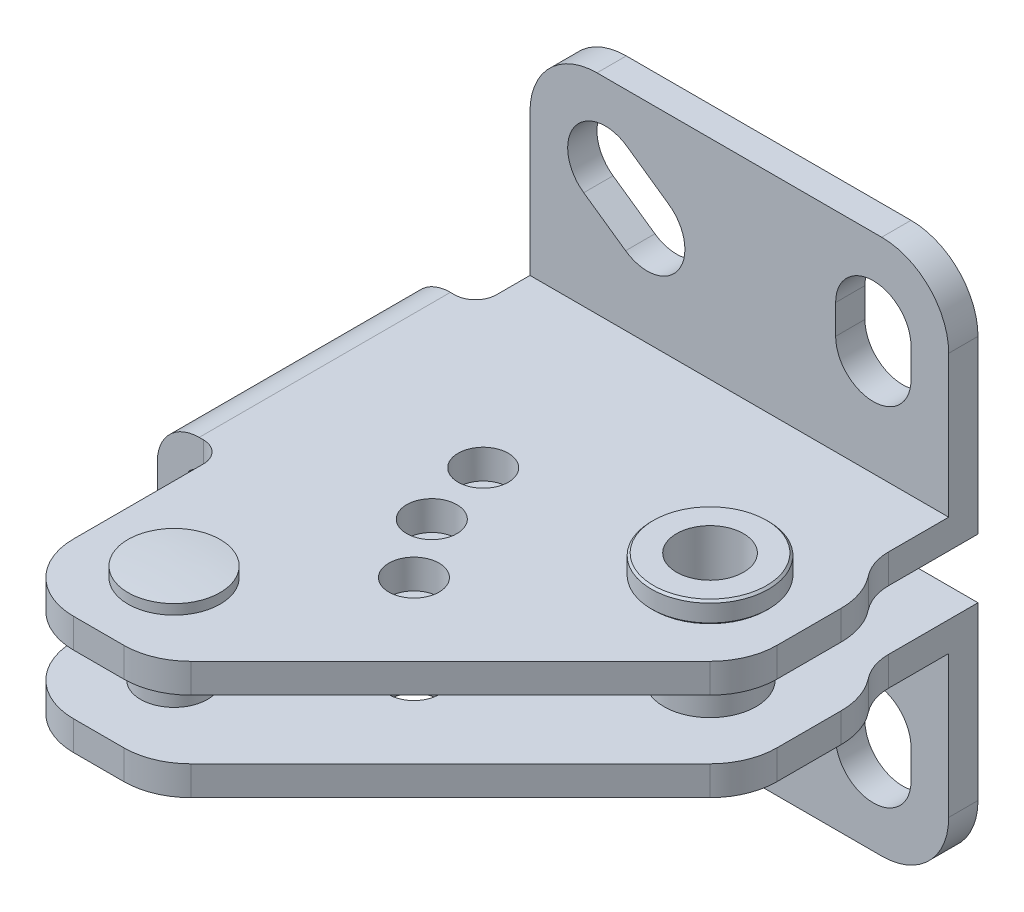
ISO-10303-21;
HEADER;
FILE_DESCRIPTION(('STEP AP214'),'2;1');
FILE_NAME('part.step','',(''),(''),'','','');
FILE_SCHEMA(('AUTOMOTIVE_DESIGN { 1 0 10303 214 1 1 1 1 }'));
ENDSEC;
DATA;
#1=APPLICATION_CONTEXT('core data for automotive mechanical design processes');
#2=APPLICATION_PROTOCOL_DEFINITION('international standard','automotive_design',2000,#1);
#3=PRODUCT_CONTEXT('',#1,'mechanical');
#4=PRODUCT('Part','Part','',(#3));
#5=PRODUCT_RELATED_PRODUCT_CATEGORY('part','',(#4));
#6=PRODUCT_DEFINITION_FORMATION('','',#4);
#7=PRODUCT_DEFINITION_CONTEXT('part definition',#1,'design');
#8=PRODUCT_DEFINITION('design','',#6,#7);
#9=PRODUCT_DEFINITION_SHAPE('','',#8);
#10=(LENGTH_UNIT() NAMED_UNIT(*) SI_UNIT(.MILLI.,.METRE.));
#11=(NAMED_UNIT(*) PLANE_ANGLE_UNIT() SI_UNIT($,.RADIAN.));
#12=(NAMED_UNIT(*) SI_UNIT($,.STERADIAN.) SOLID_ANGLE_UNIT());
#13=UNCERTAINTY_MEASURE_WITH_UNIT(LENGTH_MEASURE(1.E-05),#10,'distance_accuracy_value','');
#14=(GEOMETRIC_REPRESENTATION_CONTEXT(3) GLOBAL_UNCERTAINTY_ASSIGNED_CONTEXT((#13)) GLOBAL_UNIT_ASSIGNED_CONTEXT((#10,
#11,#12)) REPRESENTATION_CONTEXT('',''));
#15=CARTESIAN_POINT('',(0.,0.,0.));
#16=DIRECTION('',(0.,0.,1.));
#17=DIRECTION('',(1.,0.,0.));
#18=AXIS2_PLACEMENT_3D('',#15,#16,#17);
#19=CARTESIAN_POINT('',(33.,12.85,24.));
#20=DIRECTION('',(0.,1.,0.));
#21=DIRECTION('',(1.,0.,0.));
#22=AXIS2_PLACEMENT_3D('',#19,#20,#21);
#23=CYLINDRICAL_SURFACE('',#22,4.);
#24=CARTESIAN_POINT('',(33.,12.9,24.));
#25=DIRECTION('',(0.,-1.,0.));
#26=DIRECTION('',(0.,0.,1.));
#27=AXIS2_PLACEMENT_3D('',#24,#25,#26);
#28=CIRCLE('',#27,4.);
#29=CARTESIAN_POINT('',(33.,12.9,28.));
#30=VERTEX_POINT('',#29);
#31=EDGE_CURVE('E1362',#30,#30,#28,.T.);
#32=ORIENTED_EDGE('',*,*,#31,.T.);
#33=EDGE_LOOP('',(#32));
#34=FACE_BOUND('',#33,.T.);
#35=CARTESIAN_POINT('',(33.,32.1,24.));
#36=DIRECTION('',(0.,1.,0.));
#37=DIRECTION('',(0.,0.,-1.));
#38=AXIS2_PLACEMENT_3D('',#35,#36,#37);
#39=CIRCLE('',#38,4.);
#40=CARTESIAN_POINT('',(33.,32.1,20.));
#41=VERTEX_POINT('',#40);
#42=EDGE_CURVE('E1358',#41,#41,#39,.T.);
#43=ORIENTED_EDGE('',*,*,#42,.T.);
#44=EDGE_LOOP('',(#43));
#45=FACE_BOUND('',#44,.T.);
#46=ADVANCED_FACE('F14',(#34,#45),#23,.F.);
#47=CARTESIAN_POINT('',(33.,15.45,24.));
#48=DIRECTION('',(0.,-1.,0.));
#49=DIRECTION('',(-1.,0.,0.));
#50=AXIS2_PLACEMENT_3D('',#47,#48,#49);
#51=CYLINDRICAL_SURFACE('',#50,7.);
#52=CARTESIAN_POINT('',(33.,13.15,24.));
#53=DIRECTION('',(0.,-1.,0.));
#54=DIRECTION('',(0.,0.,1.));
#55=AXIS2_PLACEMENT_3D('',#52,#53,#54);
#56=CIRCLE('',#55,7.);
#57=CARTESIAN_POINT('',(33.,13.15,31.));
#58=VERTEX_POINT('',#57);
#59=EDGE_CURVE('E955',#58,#58,#56,.F.);
#60=ORIENTED_EDGE('',*,*,#59,.T.);
#61=EDGE_LOOP('',(#60));
#62=FACE_BOUND('',#61,.T.);
#63=CARTESIAN_POINT('',(33.,15.25,24.));
#64=DIRECTION('',(0.,-1.,0.));
#65=DIRECTION('',(-1.,0.,0.));
#66=AXIS2_PLACEMENT_3D('',#63,#64,#65);
#67=CIRCLE('',#66,7.);
#68=CARTESIAN_POINT('',(26.,15.25,24.));
#69=VERTEX_POINT('',#68);
#70=EDGE_CURVE('E2395',#69,#69,#67,.T.);
#71=ORIENTED_EDGE('',*,*,#70,.T.);
#72=EDGE_LOOP('',(#71));
#73=FACE_BOUND('',#72,.T.);
#74=ADVANCED_FACE('F976',(#62,#73),#51,.T.);
#75=CARTESIAN_POINT('',(33.,15.45,24.));
#76=DIRECTION('',(0.,-1.,0.));
#77=DIRECTION('',(-1.,0.,0.));
#78=AXIS2_PLACEMENT_3D('',#75,#76,#77);
#79=CONICAL_SURFACE('',#78,6.8,0.785398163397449);
#80=ORIENTED_EDGE('',*,*,#70,.F.);
#81=EDGE_LOOP('',(#80));
#82=FACE_BOUND('',#81,.T.);
#83=CARTESIAN_POINT('',(33.,15.45,24.));
#84=DIRECTION('',(0.,-1.,0.));
#85=DIRECTION('',(-1.,0.,0.));
#86=AXIS2_PLACEMENT_3D('',#83,#84,#85);
#87=CIRCLE('',#86,6.8);
#88=CARTESIAN_POINT('',(26.2,15.45,24.));
#89=VERTEX_POINT('',#88);
#90=EDGE_CURVE('E956',#89,#89,#87,.T.);
#91=ORIENTED_EDGE('',*,*,#90,.T.);
#92=EDGE_LOOP('',(#91));
#93=FACE_BOUND('',#92,.T.);
#94=ADVANCED_FACE('F983',(#82,#93),#79,.T.);
#95=CARTESIAN_POINT('',(1.,16.5,56.));
#96=DIRECTION('',(0.,-1.,0.));
#97=DIRECTION('',(0.,0.,-1.));
#98=AXIS2_PLACEMENT_3D('',#95,#96,#97);
#99=CONICAL_SURFACE('',#98,2.75,1.04719755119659);
#100=CARTESIAN_POINT('',(1.,18.0877132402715,56.));
#101=VERTEX_POINT('',#100);
#102=VERTEX_LOOP('',#101);
#103=FACE_BOUND('',#102,.T.);
#104=CARTESIAN_POINT('',(1.,16.5,56.));
#105=DIRECTION('',(0.,1.,0.));
#106=DIRECTION('',(0.,0.,1.));
#107=AXIS2_PLACEMENT_3D('',#104,#105,#106);
#108=CIRCLE('',#107,2.75);
#109=CARTESIAN_POINT('',(1.,16.5,58.75));
#110=VERTEX_POINT('',#109);
#111=EDGE_CURVE('E931',#110,#110,#108,.T.);
#112=ORIENTED_EDGE('',*,*,#111,.F.);
#113=EDGE_LOOP('',(#112));
#114=FACE_BOUND('',#113,.T.);
#115=ADVANCED_FACE('F992',(#103,#114),#99,.F.);
#116=CARTESIAN_POINT('',(33.,12.85,24.));
#117=DIRECTION('',(0.,1.,0.));
#118=DIRECTION('',(1.,0.,0.));
#119=AXIS2_PLACEMENT_3D('',#116,#117,#118);
#120=CYLINDRICAL_SURFACE('',#119,7.);
#121=CARTESIAN_POINT('',(33.,31.85,24.));
#122=DIRECTION('',(0.,1.,0.));
#123=DIRECTION('',(0.,0.,-1.));
#124=AXIS2_PLACEMENT_3D('',#121,#122,#123);
#125=CIRCLE('',#124,7.);
#126=CARTESIAN_POINT('',(33.,31.85,17.));
#127=VERTEX_POINT('',#126);
#128=EDGE_CURVE('E9',#127,#127,#125,.F.);
#129=ORIENTED_EDGE('',*,*,#128,.T.);
#130=EDGE_LOOP('',(#129));
#131=FACE_BOUND('',#130,.T.);
#132=CARTESIAN_POINT('',(33.,29.8,24.));
#133=DIRECTION('',(0.,1.,0.));
#134=DIRECTION('',(1.,0.,0.));
#135=AXIS2_PLACEMENT_3D('',#132,#133,#134);
#136=CIRCLE('',#135,7.);
#137=CARTESIAN_POINT('',(40.,29.8,24.));
#138=VERTEX_POINT('',#137);
#139=EDGE_CURVE('E2379',#138,#138,#136,.T.);
#140=ORIENTED_EDGE('',*,*,#139,.T.);
#141=EDGE_LOOP('',(#140));
#142=FACE_BOUND('',#141,.T.);
#143=ADVANCED_FACE('F995',(#131,#142),#120,.T.);
#144=CARTESIAN_POINT('',(1.,-28.9999999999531,55.9999999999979));
#145=DIRECTION('',(0.,1.,0.));
#146=DIRECTION('',(0.,0.,1.));
#147=AXIS2_PLACEMENT_3D('',#144,#145,#146);
#148=SPHERICAL_SURFACE('',#147,59.9999999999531);
#149=CARTESIAN_POINT('',(1.,30.7473848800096,56.));
#150=DIRECTION('',(0.,1.,0.));
#151=DIRECTION('',(0.,0.,1.));
#152=AXIS2_PLACEMENT_3D('',#149,#150,#151);
#153=CIRCLE('',#152,5.5);
#154=CARTESIAN_POINT('',(1.,30.7473848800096,61.5));
#155=VERTEX_POINT('',#154);
#156=EDGE_CURVE('E2404',#155,#155,#153,.T.);
#157=ORIENTED_EDGE('',*,*,#156,.T.);
#158=EDGE_LOOP('',(#157));
#159=FACE_BOUND('',#158,.T.);
#160=ADVANCED_FACE('F1024',(#159),#148,.T.);
#161=CARTESIAN_POINT('',(7.58058054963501,45.186543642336,3.5));
#162=DIRECTION('',(-0.573462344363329,-0.81923192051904,0.));
#163=DIRECTION('',(0.81923192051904,-0.573462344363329,0.));
#164=AXIS2_PLACEMENT_3D('',#161,#162,#163);
#165=PLANE('',#164);
#166=DIRECTION('',(-0.81923192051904,0.573462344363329,0.));
#167=VECTOR('',#166,1.);
#168=CARTESIAN_POINT('',(7.58058054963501,45.186543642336,0.));
#169=LINE('',#168,#167);
#170=CARTESIAN_POINT('',(7.58058054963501,45.186543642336,0.));
#171=VERTEX_POINT('',#170);
#172=CARTESIAN_POINT('',(2.580580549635,48.686543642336,0.));
#173=VERTEX_POINT('',#172);
#174=EDGE_CURVE('E1345',#171,#173,#169,.T.);
#175=ORIENTED_EDGE('',*,*,#174,.F.);
#176=DIRECTION('',(0.,0.,-1.));
#177=VECTOR('',#176,1.);
#178=CARTESIAN_POINT('',(7.58058054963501,45.186543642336,3.5));
#179=LINE('',#178,#177);
#180=CARTESIAN_POINT('',(7.58058054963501,45.186543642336,3.5));
#181=VERTEX_POINT('',#180);
#182=EDGE_CURVE('E410',#181,#171,#179,.T.);
#183=ORIENTED_EDGE('',*,*,#182,.F.);
#184=DIRECTION('',(-0.81923192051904,0.573462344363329,0.));
#185=VECTOR('',#184,1.);
#186=CARTESIAN_POINT('',(7.58058054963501,45.186543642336,3.5));
#187=LINE('',#186,#185);
#188=CARTESIAN_POINT('',(2.580580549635,48.686543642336,3.5));
#189=VERTEX_POINT('',#188);
#190=EDGE_CURVE('E415',#181,#189,#187,.T.);
#191=ORIENTED_EDGE('',*,*,#190,.T.);
#192=DIRECTION('',(0.,0.,-1.));
#193=VECTOR('',#192,1.);
#194=CARTESIAN_POINT('',(2.580580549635,48.686543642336,3.5));
#195=LINE('',#194,#193);
#196=EDGE_CURVE('E398',#189,#173,#195,.T.);
#197=ORIENTED_EDGE('',*,*,#196,.T.);
#198=EDGE_LOOP('',(#175,#183,#191,#197));
#199=FACE_BOUND('',#198,.T.);
#200=ADVANCED_FACE('F416',(#199),#165,.T.);
#201=CARTESIAN_POINT('',(0.,45.,3.5));
#202=DIRECTION('',(0.,0.,-1.));
#203=DIRECTION('',(0.,-1.,0.));
#204=AXIS2_PLACEMENT_3D('',#201,#202,#203);
#205=CYLINDRICAL_SURFACE('',#204,4.50000000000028);
#206=CARTESIAN_POINT('',(0.,45.,0.));
#207=DIRECTION('',(0.,0.,1.));
#208=DIRECTION('',(1.,0.,0.));
#209=AXIS2_PLACEMENT_3D('',#206,#207,#208);
#210=CIRCLE('',#209,4.50000000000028);
#211=CARTESIAN_POINT('',(-2.58058054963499,41.313456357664,0.));
#212=VERTEX_POINT('',#211);
#213=EDGE_CURVE('E406',#173,#212,#210,.T.);
#214=ORIENTED_EDGE('',*,*,#213,.F.);
#215=ORIENTED_EDGE('',*,*,#196,.F.);
#216=CARTESIAN_POINT('',(0.,45.,3.5));
#217=DIRECTION('',(0.,0.,1.));
#218=DIRECTION('',(1.,0.,0.));
#219=AXIS2_PLACEMENT_3D('',#216,#217,#218);
#220=CIRCLE('',#219,4.50000000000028);
#221=CARTESIAN_POINT('',(-2.58058054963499,41.313456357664,3.5));
#222=VERTEX_POINT('',#221);
#223=EDGE_CURVE('E403',#189,#222,#220,.T.);
#224=ORIENTED_EDGE('',*,*,#223,.T.);
#225=DIRECTION('',(0.,0.,-1.));
#226=VECTOR('',#225,1.);
#227=CARTESIAN_POINT('',(-2.58058054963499,41.313456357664,3.5));
#228=LINE('',#227,#226);
#229=EDGE_CURVE('E411',#222,#212,#228,.T.);
#230=ORIENTED_EDGE('',*,*,#229,.T.);
#231=EDGE_LOOP('',(#214,#215,#224,#230));
#232=FACE_BOUND('',#231,.T.);
#233=ADVANCED_FACE('F400',(#232),#205,.F.);
#234=CARTESIAN_POINT('',(-2.58058054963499,41.313456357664,3.5));
#235=DIRECTION('',(0.573462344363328,0.819231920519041,0.));
#236=DIRECTION('',(-0.819231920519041,0.573462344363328,0.));
#237=AXIS2_PLACEMENT_3D('',#234,#235,#236);
#238=PLANE('',#237);
#239=DIRECTION('',(0.819231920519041,-0.573462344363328,0.));
#240=VECTOR('',#239,1.);
#241=CARTESIAN_POINT('',(-2.58058054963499,41.313456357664,0.));
#242=LINE('',#241,#240);
#243=CARTESIAN_POINT('',(2.419419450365,37.813456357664,0.));
#244=VERTEX_POINT('',#243);
#245=EDGE_CURVE('E1354',#212,#244,#242,.T.);
#246=ORIENTED_EDGE('',*,*,#245,.F.);
#247=ORIENTED_EDGE('',*,*,#229,.F.);
#248=DIRECTION('',(0.819231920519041,-0.573462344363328,0.));
#249=VECTOR('',#248,1.);
#250=CARTESIAN_POINT('',(-2.58058054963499,41.313456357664,3.5));
#251=LINE('',#250,#249);
#252=CARTESIAN_POINT('',(2.419419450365,37.813456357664,3.5));
#253=VERTEX_POINT('',#252);
#254=EDGE_CURVE('E423',#222,#253,#251,.T.);
#255=ORIENTED_EDGE('',*,*,#254,.T.);
#256=DIRECTION('',(0.,0.,-1.));
#257=VECTOR('',#256,1.);
#258=CARTESIAN_POINT('',(2.419419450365,37.813456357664,3.5));
#259=LINE('',#258,#257);
#260=EDGE_CURVE('E430',#253,#244,#259,.T.);
#261=ORIENTED_EDGE('',*,*,#260,.T.);
#262=EDGE_LOOP('',(#246,#247,#255,#261));
#263=FACE_BOUND('',#262,.T.);
#264=ADVANCED_FACE('F1030',(#263),#238,.T.);
#265=CARTESIAN_POINT('',(5.,41.5,3.5));
#266=DIRECTION('',(0.,0.,-1.));
#267=DIRECTION('',(0.,-1.,0.));
#268=AXIS2_PLACEMENT_3D('',#265,#266,#267);
#269=CYLINDRICAL_SURFACE('',#268,4.50000000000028);
#270=CARTESIAN_POINT('',(5.,41.5,0.));
#271=DIRECTION('',(0.,0.,1.));
#272=DIRECTION('',(-1.,0.,0.));
#273=AXIS2_PLACEMENT_3D('',#270,#271,#272);
#274=CIRCLE('',#273,4.50000000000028);
#275=EDGE_CURVE('E1349',#244,#171,#274,.T.);
#276=ORIENTED_EDGE('',*,*,#275,.F.);
#277=ORIENTED_EDGE('',*,*,#260,.F.);
#278=CARTESIAN_POINT('',(5.,41.5,3.5));
#279=DIRECTION('',(0.,0.,1.));
#280=DIRECTION('',(-1.,0.,0.));
#281=AXIS2_PLACEMENT_3D('',#278,#279,#280);
#282=CIRCLE('',#281,4.50000000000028);
#283=EDGE_CURVE('E419',#253,#181,#282,.T.);
#284=ORIENTED_EDGE('',*,*,#283,.T.);
#285=ORIENTED_EDGE('',*,*,#182,.T.);
#286=EDGE_LOOP('',(#276,#277,#284,#285));
#287=FACE_BOUND('',#286,.T.);
#288=ADVANCED_FACE('F1033',(#287),#269,.F.);
#289=CARTESIAN_POINT('',(-0.999999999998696,46.4999999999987,3.5));
#290=DIRECTION('',(0.,0.,-1.));
#291=DIRECTION('',(0.,-1.,0.));
#292=AXIS2_PLACEMENT_3D('',#289,#290,#291);
#293=CYLINDRICAL_SURFACE('',#292,8.0000000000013);
#294=CARTESIAN_POINT('',(-0.999999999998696,46.4999999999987,0.));
#295=DIRECTION('',(0.,0.,1.));
#296=DIRECTION('',(1.,0.,0.));
#297=AXIS2_PLACEMENT_3D('',#294,#295,#296);
#298=CIRCLE('',#297,8.0000000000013);
#299=CARTESIAN_POINT('',(-1.,54.5,0.));
#300=VERTEX_POINT('',#299);
#301=CARTESIAN_POINT('',(-9.,46.4999999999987,0.));
#302=VERTEX_POINT('',#301);
#303=EDGE_CURVE('E703',#300,#302,#298,.T.);
#304=ORIENTED_EDGE('',*,*,#303,.T.);
#305=DIRECTION('',(0.,0.,-1.));
#306=VECTOR('',#305,1.);
#307=CARTESIAN_POINT('',(-9.,46.4999999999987,3.5));
#308=LINE('',#307,#306);
#309=CARTESIAN_POINT('',(-9.,46.4999999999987,3.5));
#310=VERTEX_POINT('',#309);
#311=EDGE_CURVE('E748',#310,#302,#308,.T.);
#312=ORIENTED_EDGE('',*,*,#311,.F.);
#313=CARTESIAN_POINT('',(-0.999999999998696,46.4999999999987,3.5));
#314=DIRECTION('',(0.,0.,1.));
#315=DIRECTION('',(1.,0.,0.));
#316=AXIS2_PLACEMENT_3D('',#313,#314,#315);
#317=CIRCLE('',#316,8.0000000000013);
#318=CARTESIAN_POINT('',(-1.,54.5,3.5));
#319=VERTEX_POINT('',#318);
#320=EDGE_CURVE('E723',#319,#310,#317,.T.);
#321=ORIENTED_EDGE('',*,*,#320,.F.);
#322=DIRECTION('',(0.,0.,-1.));
#323=VECTOR('',#322,1.);
#324=CARTESIAN_POINT('',(-1.,54.5,3.5));
#325=LINE('',#324,#323);
#326=EDGE_CURVE('E751',#319,#300,#325,.T.);
#327=ORIENTED_EDGE('',*,*,#326,.T.);
#328=EDGE_LOOP('',(#304,#312,#321,#327));
#329=FACE_BOUND('',#328,.T.);
#330=ADVANCED_FACE('F1036',(#329),#293,.T.);
#331=CARTESIAN_POINT('',(33.,54.5,3.5));
#332=DIRECTION('',(0.,-1.,0.));
#333=DIRECTION('',(1.,0.,0.));
#334=AXIS2_PLACEMENT_3D('',#331,#332,#333);
#335=PLANE('',#334);
#336=DIRECTION('',(-1.,0.,0.));
#337=VECTOR('',#336,1.);
#338=CARTESIAN_POINT('',(33.,54.5,0.));
#339=LINE('',#338,#337);
#340=CARTESIAN_POINT('',(33.,54.5,0.));
#341=VERTEX_POINT('',#340);
#342=EDGE_CURVE('E700',#341,#300,#339,.T.);
#343=ORIENTED_EDGE('',*,*,#342,.T.);
#344=ORIENTED_EDGE('',*,*,#326,.F.);
#345=DIRECTION('',(-1.,0.,0.));
#346=VECTOR('',#345,1.);
#347=CARTESIAN_POINT('',(33.,54.5,3.5));
#348=LINE('',#347,#346);
#349=CARTESIAN_POINT('',(33.,54.5,3.5));
#350=VERTEX_POINT('',#349);
#351=EDGE_CURVE('E720',#350,#319,#348,.T.);
#352=ORIENTED_EDGE('',*,*,#351,.F.);
#353=DIRECTION('',(0.,0.,-1.));
#354=VECTOR('',#353,1.);
#355=CARTESIAN_POINT('',(33.,54.5,3.5));
#356=LINE('',#355,#354);
#357=EDGE_CURVE('E754',#350,#341,#356,.T.);
#358=ORIENTED_EDGE('',*,*,#357,.T.);
#359=EDGE_LOOP('',(#343,#344,#352,#358));
#360=FACE_BOUND('',#359,.T.);
#361=ADVANCED_FACE('F1049',(#360),#335,.F.);
#362=CARTESIAN_POINT('',(27.5,45.,3.5));
#363=DIRECTION('',(1.,0.,0.));
#364=DIRECTION('',(0.,1.,0.));
#365=AXIS2_PLACEMENT_3D('',#362,#363,#364);
#366=PLANE('',#365);
#367=DIRECTION('',(0.,-1.,0.));
#368=VECTOR('',#367,1.);
#369=CARTESIAN_POINT('',(27.5,45.,0.));
#370=LINE('',#369,#368);
#371=CARTESIAN_POINT('',(27.5,45.,0.));
#372=VERTEX_POINT('',#371);
#373=CARTESIAN_POINT('',(27.5,41.5,0.));
#374=VERTEX_POINT('',#373);
#375=EDGE_CURVE('E438',#372,#374,#370,.T.);
#376=ORIENTED_EDGE('',*,*,#375,.F.);
#377=DIRECTION('',(0.,0.,-1.));
#378=VECTOR('',#377,1.);
#379=CARTESIAN_POINT('',(27.5,45.,3.5));
#380=LINE('',#379,#378);
#381=CARTESIAN_POINT('',(27.5,45.,3.5));
#382=VERTEX_POINT('',#381);
#383=EDGE_CURVE('E463',#382,#372,#380,.T.);
#384=ORIENTED_EDGE('',*,*,#383,.F.);
#385=DIRECTION('',(0.,-1.,0.));
#386=VECTOR('',#385,1.);
#387=CARTESIAN_POINT('',(27.5,45.,3.5));
#388=LINE('',#387,#386);
#389=CARTESIAN_POINT('',(27.5,41.5,3.5));
#390=VERTEX_POINT('',#389);
#391=EDGE_CURVE('E452',#382,#390,#388,.T.);
#392=ORIENTED_EDGE('',*,*,#391,.T.);
#393=DIRECTION('',(0.,0.,-1.));
#394=VECTOR('',#393,1.);
#395=CARTESIAN_POINT('',(27.5,41.5,3.5));
#396=LINE('',#395,#394);
#397=EDGE_CURVE('E461',#390,#374,#396,.T.);
#398=ORIENTED_EDGE('',*,*,#397,.T.);
#399=EDGE_LOOP('',(#376,#384,#392,#398));
#400=FACE_BOUND('',#399,.T.);
#401=ADVANCED_FACE('F1045',(#400),#366,.T.);
#402=CARTESIAN_POINT('',(32.,41.5,3.5));
#403=DIRECTION('',(0.,0.,-1.));
#404=DIRECTION('',(0.,-1.,0.));
#405=AXIS2_PLACEMENT_3D('',#402,#403,#404);
#406=CYLINDRICAL_SURFACE('',#405,4.5);
#407=CARTESIAN_POINT('',(32.,41.5,0.));
#408=DIRECTION('',(0.,0.,1.));
#409=DIRECTION('',(-1.,0.,0.));
#410=AXIS2_PLACEMENT_3D('',#407,#408,#409);
#411=CIRCLE('',#410,4.5);
#412=CARTESIAN_POINT('',(36.5,41.5,0.));
#413=VERTEX_POINT('',#412);
#414=EDGE_CURVE('E442',#374,#413,#411,.T.);
#415=ORIENTED_EDGE('',*,*,#414,.F.);
#416=ORIENTED_EDGE('',*,*,#397,.F.);
#417=CARTESIAN_POINT('',(32.,41.5,3.5));
#418=DIRECTION('',(0.,0.,1.));
#419=DIRECTION('',(-1.,0.,0.));
#420=AXIS2_PLACEMENT_3D('',#417,#418,#419);
#421=CIRCLE('',#420,4.5);
#422=CARTESIAN_POINT('',(36.5,41.5,3.5));
#423=VERTEX_POINT('',#422);
#424=EDGE_CURVE('E455',#390,#423,#421,.T.);
#425=ORIENTED_EDGE('',*,*,#424,.T.);
#426=DIRECTION('',(0.,0.,-1.));
#427=VECTOR('',#426,1.);
#428=CARTESIAN_POINT('',(36.5,41.5,3.5));
#429=LINE('',#428,#427);
#430=EDGE_CURVE('E457',#423,#413,#429,.T.);
#431=ORIENTED_EDGE('',*,*,#430,.T.);
#432=EDGE_LOOP('',(#415,#416,#425,#431));
#433=FACE_BOUND('',#432,.T.);
#434=ADVANCED_FACE('F1041',(#433),#406,.F.);
#435=CARTESIAN_POINT('',(36.5,41.5,3.5));
#436=DIRECTION('',(-1.,0.,0.));
#437=DIRECTION('',(0.,-1.,0.));
#438=AXIS2_PLACEMENT_3D('',#435,#436,#437);
#439=PLANE('',#438);
#440=DIRECTION('',(0.,1.,0.));
#441=VECTOR('',#440,1.);
#442=CARTESIAN_POINT('',(36.5,41.5,0.));
#443=LINE('',#442,#441);
#444=CARTESIAN_POINT('',(36.5,45.,0.));
#445=VERTEX_POINT('',#444);
#446=EDGE_CURVE('E433',#413,#445,#443,.T.);
#447=ORIENTED_EDGE('',*,*,#446,.F.);
#448=ORIENTED_EDGE('',*,*,#430,.F.);
#449=DIRECTION('',(0.,1.,0.));
#450=VECTOR('',#449,1.);
#451=CARTESIAN_POINT('',(36.5,41.5,3.5));
#452=LINE('',#451,#450);
#453=CARTESIAN_POINT('',(36.5,45.,3.5));
#454=VERTEX_POINT('',#453);
#455=EDGE_CURVE('E446',#423,#454,#452,.T.);
#456=ORIENTED_EDGE('',*,*,#455,.T.);
#457=DIRECTION('',(0.,0.,-1.));
#458=VECTOR('',#457,1.);
#459=CARTESIAN_POINT('',(36.5,45.,3.5));
#460=LINE('',#459,#458);
#461=EDGE_CURVE('E465',#454,#445,#460,.T.);
#462=ORIENTED_EDGE('',*,*,#461,.T.);
#463=EDGE_LOOP('',(#447,#448,#456,#462));
#464=FACE_BOUND('',#463,.T.);
#465=ADVANCED_FACE('F1044',(#464),#439,.T.);
#466=CARTESIAN_POINT('',(32.,45.,3.5));
#467=DIRECTION('',(0.,0.,-1.));
#468=DIRECTION('',(0.,-1.,0.));
#469=AXIS2_PLACEMENT_3D('',#466,#467,#468);
#470=CYLINDRICAL_SURFACE('',#469,4.5);
#471=CARTESIAN_POINT('',(32.,45.,0.));
#472=DIRECTION('',(0.,0.,1.));
#473=DIRECTION('',(1.,0.,0.));
#474=AXIS2_PLACEMENT_3D('',#471,#472,#473);
#475=CIRCLE('',#474,4.5);
#476=EDGE_CURVE('E434',#445,#372,#475,.T.);
#477=ORIENTED_EDGE('',*,*,#476,.F.);
#478=ORIENTED_EDGE('',*,*,#461,.F.);
#479=CARTESIAN_POINT('',(32.,45.,3.5));
#480=DIRECTION('',(0.,0.,1.));
#481=DIRECTION('',(1.,0.,0.));
#482=AXIS2_PLACEMENT_3D('',#479,#480,#481);
#483=CIRCLE('',#482,4.5);
#484=EDGE_CURVE('E450',#454,#382,#483,.T.);
#485=ORIENTED_EDGE('',*,*,#484,.T.);
#486=ORIENTED_EDGE('',*,*,#383,.T.);
#487=EDGE_LOOP('',(#477,#478,#485,#486));
#488=FACE_BOUND('',#487,.T.);
#489=ADVANCED_FACE('F1051',(#488),#470,.F.);
#490=CARTESIAN_POINT('',(32.9999999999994,46.4999999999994,3.5));
#491=DIRECTION('',(0.,0.,-1.));
#492=DIRECTION('',(0.,-1.,0.));
#493=AXIS2_PLACEMENT_3D('',#490,#491,#492);
#494=CYLINDRICAL_SURFACE('',#493,8.00000000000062);
#495=CARTESIAN_POINT('',(32.9999999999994,46.4999999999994,0.));
#496=DIRECTION('',(0.,0.,1.));
#497=DIRECTION('',(-1.,0.,0.));
#498=AXIS2_PLACEMENT_3D('',#495,#496,#497);
#499=CIRCLE('',#498,8.00000000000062);
#500=CARTESIAN_POINT('',(41.,46.5,0.));
#501=VERTEX_POINT('',#500);
#502=EDGE_CURVE('E697',#501,#341,#499,.T.);
#503=ORIENTED_EDGE('',*,*,#502,.T.);
#504=ORIENTED_EDGE('',*,*,#357,.F.);
#505=CARTESIAN_POINT('',(32.9999999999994,46.4999999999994,3.5));
#506=DIRECTION('',(0.,0.,1.));
#507=DIRECTION('',(-1.,0.,0.));
#508=AXIS2_PLACEMENT_3D('',#505,#506,#507);
#509=CIRCLE('',#508,8.00000000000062);
#510=CARTESIAN_POINT('',(41.,46.5,3.5));
#511=VERTEX_POINT('',#510);
#512=EDGE_CURVE('E718',#511,#350,#509,.T.);
#513=ORIENTED_EDGE('',*,*,#512,.F.);
#514=DIRECTION('',(0.,0.,-1.));
#515=VECTOR('',#514,1.);
#516=CARTESIAN_POINT('',(41.,46.5,3.5));
#517=LINE('',#516,#515);
#518=EDGE_CURVE('E757',#511,#501,#517,.T.);
#519=ORIENTED_EDGE('',*,*,#518,.T.);
#520=EDGE_LOOP('',(#503,#504,#513,#519));
#521=FACE_BOUND('',#520,.T.);
#522=ADVANCED_FACE('F1000',(#521),#494,.T.);
#523=CARTESIAN_POINT('',(1.,18.0877132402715,56.));
#524=DIRECTION('',(0.,1.,0.));
#525=DIRECTION('',(0.,0.,1.));
#526=AXIS2_PLACEMENT_3D('',#523,#524,#525);
#527=CYLINDRICAL_SURFACE('',#526,2.75);
#528=ORIENTED_EDGE('',*,*,#111,.T.);
#529=EDGE_LOOP('',(#528));
#530=FACE_BOUND('',#529,.T.);
#531=CARTESIAN_POINT('',(1.,14.0630539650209,56.));
#532=DIRECTION('',(0.,1.,0.));
#533=DIRECTION('',(0.,0.,1.));
#534=AXIS2_PLACEMENT_3D('',#531,#532,#533);
#535=CIRCLE('',#534,2.75);
#536=CARTESIAN_POINT('',(1.,14.0630539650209,53.2500000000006));
#537=VERTEX_POINT('',#536);
#538=EDGE_CURVE('E2398',#537,#537,#535,.T.);
#539=ORIENTED_EDGE('',*,*,#538,.F.);
#540=EDGE_LOOP('',(#539));
#541=FACE_BOUND('',#540,.T.);
#542=ADVANCED_FACE('F996',(#530,#541),#527,.F.);
#543=CARTESIAN_POINT('',(1.,18.0877132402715,56.));
#544=DIRECTION('',(0.,1.,0.));
#545=DIRECTION('',(0.,0.,1.));
#546=AXIS2_PLACEMENT_3D('',#543,#544,#545);
#547=CYLINDRICAL_SURFACE('',#546,4.);
#548=CARTESIAN_POINT('',(1.,26.05,56.));
#549=DIRECTION('',(0.,-1.,0.));
#550=DIRECTION('',(1.,0.,0.));
#551=AXIS2_PLACEMENT_3D('',#548,#549,#550);
#552=CIRCLE('',#551,4.);
#553=CARTESIAN_POINT('',(5.,26.05,56.));
#554=VERTEX_POINT('',#553);
#555=EDGE_CURVE('E936',#554,#554,#552,.F.);
#556=ORIENTED_EDGE('',*,*,#555,.F.);
#557=EDGE_LOOP('',(#556));
#558=FACE_BOUND('',#557,.T.);
#559=CARTESIAN_POINT('',(1.,18.95,56.));
#560=DIRECTION('',(0.,1.,0.));
#561=DIRECTION('',(-1.,0.,0.));
#562=AXIS2_PLACEMENT_3D('',#559,#560,#561);
#563=CIRCLE('',#562,4.);
#564=CARTESIAN_POINT('',(-3.,18.95,56.));
#565=VERTEX_POINT('',#564);
#566=EDGE_CURVE('E932',#565,#565,#563,.T.);
#567=ORIENTED_EDGE('',*,*,#566,.T.);
#568=EDGE_LOOP('',(#567));
#569=FACE_BOUND('',#568,.T.);
#570=ADVANCED_FACE('F999',(#558,#569),#547,.T.);
#571=CARTESIAN_POINT('',(41.,15.45,0.));
#572=DIRECTION('',(0.,0.,-1.));
#573=DIRECTION('',(0.,-1.,0.));
#574=AXIS2_PLACEMENT_3D('',#571,#572,#573);
#575=PLANE('',#574);
#576=ORIENTED_EDGE('',*,*,#414,.T.);
#577=ORIENTED_EDGE('',*,*,#446,.T.);
#578=ORIENTED_EDGE('',*,*,#476,.T.);
#579=ORIENTED_EDGE('',*,*,#375,.T.);
#580=EDGE_LOOP('',(#576,#577,#578,#579));
#581=FACE_BOUND('',#580,.T.);
#582=DIRECTION('',(0.,1.,0.));
#583=VECTOR('',#582,1.);
#584=CARTESIAN_POINT('',(41.,15.45,0.));
#585=LINE('',#584,#583);
#586=CARTESIAN_POINT('',(41.,26.05,0.));
#587=VERTEX_POINT('',#586);
#588=EDGE_CURVE('E896',#587,#501,#585,.T.);
#589=ORIENTED_EDGE('',*,*,#588,.F.);
#590=DIRECTION('',(-1.,0.,0.));
#591=VECTOR('',#590,1.);
#592=CARTESIAN_POINT('',(47.5,26.05,0.));
#593=LINE('',#592,#591);
#594=CARTESIAN_POINT('',(-9.,26.05,0.));
#595=VERTEX_POINT('',#594);
#596=EDGE_CURVE('E585',#587,#595,#593,.T.);
#597=ORIENTED_EDGE('',*,*,#596,.T.);
#598=DIRECTION('',(0.,1.,0.));
#599=VECTOR('',#598,1.);
#600=CARTESIAN_POINT('',(-9.,15.45,0.));
#601=LINE('',#600,#599);
#602=EDGE_CURVE('E891',#595,#302,#601,.T.);
#603=ORIENTED_EDGE('',*,*,#602,.T.);
#604=ORIENTED_EDGE('',*,*,#303,.F.);
#605=ORIENTED_EDGE('',*,*,#342,.F.);
#606=ORIENTED_EDGE('',*,*,#502,.F.);
#607=EDGE_LOOP('',(#589,#597,#603,#604,#605,#606));
#608=FACE_BOUND('',#607,.T.);
#609=ORIENTED_EDGE('',*,*,#213,.T.);
#610=ORIENTED_EDGE('',*,*,#245,.T.);
#611=ORIENTED_EDGE('',*,*,#275,.T.);
#612=ORIENTED_EDGE('',*,*,#174,.T.);
#613=EDGE_LOOP('',(#609,#610,#611,#612));
#614=FACE_BOUND('',#613,.T.);
#615=ADVANCED_FACE('F1016',(#581,#608,#614),#575,.T.);
#616=CARTESIAN_POINT('',(33.,12.85,24.));
#617=DIRECTION('',(0.,1.,0.));
#618=DIRECTION('',(1.,0.,0.));
#619=AXIS2_PLACEMENT_3D('',#616,#617,#618);
#620=CYLINDRICAL_SURFACE('',#619,5.5);
#621=CARTESIAN_POINT('',(33.,26.05,24.));
#622=DIRECTION('',(0.,-1.,0.));
#623=DIRECTION('',(0.,0.,1.));
#624=AXIS2_PLACEMENT_3D('',#621,#622,#623);
#625=CIRCLE('',#624,5.5);
#626=CARTESIAN_POINT('',(33.,26.05,29.5));
#627=VERTEX_POINT('',#626);
#628=EDGE_CURVE('E2392',#627,#627,#625,.T.);
#629=ORIENTED_EDGE('',*,*,#628,.T.);
#630=EDGE_LOOP('',(#629));
#631=FACE_BOUND('',#630,.T.);
#632=CARTESIAN_POINT('',(33.,18.95,24.));
#633=DIRECTION('',(0.,1.,0.));
#634=DIRECTION('',(0.,0.,-1.));
#635=AXIS2_PLACEMENT_3D('',#632,#633,#634);
#636=CIRCLE('',#635,5.5);
#637=CARTESIAN_POINT('',(33.,18.95,18.5));
#638=VERTEX_POINT('',#637);
#639=EDGE_CURVE('E2383',#638,#638,#636,.T.);
#640=ORIENTED_EDGE('',*,*,#639,.T.);
#641=EDGE_LOOP('',(#640));
#642=FACE_BOUND('',#641,.T.);
#643=ADVANCED_FACE('F990',(#631,#642),#620,.T.);
#644=CARTESIAN_POINT('',(33.,29.55,24.));
#645=DIRECTION('',(0.,1.,0.));
#646=DIRECTION('',(1.,0.,0.));
#647=AXIS2_PLACEMENT_3D('',#644,#645,#646);
#648=CONICAL_SURFACE('',#647,6.75,0.785398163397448);
#649=ORIENTED_EDGE('',*,*,#139,.F.);
#650=EDGE_LOOP('',(#649));
#651=FACE_BOUND('',#650,.T.);
#652=CARTESIAN_POINT('',(33.,29.55,24.));
#653=DIRECTION('',(0.,1.,0.));
#654=DIRECTION('',(1.,0.,0.));
#655=AXIS2_PLACEMENT_3D('',#652,#653,#654);
#656=CIRCLE('',#655,6.75);
#657=CARTESIAN_POINT('',(39.75,29.55,24.));
#658=VERTEX_POINT('',#657);
#659=EDGE_CURVE('E2380',#658,#658,#656,.T.);
#660=ORIENTED_EDGE('',*,*,#659,.T.);
#661=EDGE_LOOP('',(#660));
#662=FACE_BOUND('',#661,.T.);
#663=ADVANCED_FACE('F1022',(#651,#662),#648,.T.);
#664=CARTESIAN_POINT('',(1.,18.0877132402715,56.));
#665=DIRECTION('',(0.,1.,0.));
#666=DIRECTION('',(0.,0.,1.));
#667=AXIS2_PLACEMENT_3D('',#664,#665,#666);
#668=CYLINDRICAL_SURFACE('',#667,5.5);
#669=CARTESIAN_POINT('',(1.,29.55,56.));
#670=DIRECTION('',(0.,1.,0.));
#671=DIRECTION('',(0.,0.,-1.));
#672=AXIS2_PLACEMENT_3D('',#669,#670,#671);
#673=CIRCLE('',#672,5.5);
#674=CARTESIAN_POINT('',(1.,29.55,50.5));
#675=VERTEX_POINT('',#674);
#676=EDGE_CURVE('E935',#675,#675,#673,.F.);
#677=ORIENTED_EDGE('',*,*,#676,.F.);
#678=EDGE_LOOP('',(#677));
#679=FACE_BOUND('',#678,.T.);
#680=ORIENTED_EDGE('',*,*,#156,.F.);
#681=EDGE_LOOP('',(#680));
#682=FACE_BOUND('',#681,.T.);
#683=ADVANCED_FACE('F1018',(#679,#682),#668,.T.);
#684=CARTESIAN_POINT('',(10.342305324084,29.55,34.565456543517));
#685=DIRECTION('',(0.,-1.,0.));
#686=DIRECTION('',(1.,0.,0.));
#687=AXIS2_PLACEMENT_3D('',#684,#685,#686);
#688=CYLINDRICAL_SURFACE('',#687,3.);
#689=CARTESIAN_POINT('',(10.342305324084,26.05,34.565456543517));
#690=DIRECTION('',(0.,-1.,0.));
#691=DIRECTION('',(1.,0.,0.));
#692=AXIS2_PLACEMENT_3D('',#689,#690,#691);
#693=CIRCLE('',#692,3.);
#694=CARTESIAN_POINT('',(13.342305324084,26.05,34.565456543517));
#695=VERTEX_POINT('',#694);
#696=EDGE_CURVE('E549',#695,#695,#693,.F.);
#697=ORIENTED_EDGE('',*,*,#696,.F.);
#698=EDGE_LOOP('',(#697));
#699=FACE_BOUND('',#698,.T.);
#700=CARTESIAN_POINT('',(10.342305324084,29.55,34.565456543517));
#701=DIRECTION('',(0.,1.,0.));
#702=DIRECTION('',(-1.,0.,0.));
#703=AXIS2_PLACEMENT_3D('',#700,#701,#702);
#704=CIRCLE('',#703,3.);
#705=CARTESIAN_POINT('',(7.342305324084,29.55,34.565456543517));
#706=VERTEX_POINT('',#705);
#707=EDGE_CURVE('E546',#706,#706,#704,.T.);
#708=ORIENTED_EDGE('',*,*,#707,.T.);
#709=EDGE_LOOP('',(#708));
#710=FACE_BOUND('',#709,.T.);
#711=ADVANCED_FACE('F1021',(#699,#710),#688,.F.);
#712=CARTESIAN_POINT('',(-9.,15.45,0.));
#713=DIRECTION('',(-1.,0.,0.));
#714=DIRECTION('',(0.,-1.,0.));
#715=AXIS2_PLACEMENT_3D('',#712,#713,#714);
#716=PLANE('',#715);
#717=ORIENTED_EDGE('',*,*,#602,.F.);
#718=DIRECTION('',(0.,0.,1.));
#719=VECTOR('',#718,1.);
#720=CARTESIAN_POINT('',(-9.,26.05,0.));
#721=LINE('',#720,#719);
#722=CARTESIAN_POINT('',(-9.,26.05,7.49999999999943));
#723=VERTEX_POINT('',#722);
#724=EDGE_CURVE('E643',#595,#723,#721,.T.);
#725=ORIENTED_EDGE('',*,*,#724,.T.);
#726=DIRECTION('',(0.,1.,0.));
#727=VECTOR('',#726,1.);
#728=CARTESIAN_POINT('',(-9.,15.45,7.5));
#729=LINE('',#728,#727);
#730=CARTESIAN_POINT('',(-9.,29.55,7.5));
#731=VERTEX_POINT('',#730);
#732=EDGE_CURVE('E887',#723,#731,#729,.T.);
#733=ORIENTED_EDGE('',*,*,#732,.T.);
#734=DIRECTION('',(0.,0.,1.));
#735=VECTOR('',#734,1.);
#736=CARTESIAN_POINT('',(-9.,29.55,0.));
#737=LINE('',#736,#735);
#738=CARTESIAN_POINT('',(-9.,29.55,3.5));
#739=VERTEX_POINT('',#738);
#740=EDGE_CURVE('E772',#739,#731,#737,.T.);
#741=ORIENTED_EDGE('',*,*,#740,.F.);
#742=DIRECTION('',(0.,-1.,0.));
#743=VECTOR('',#742,1.);
#744=CARTESIAN_POINT('',(-9.,46.5,3.5));
#745=LINE('',#744,#743);
#746=EDGE_CURVE('E726',#310,#739,#745,.T.);
#747=ORIENTED_EDGE('',*,*,#746,.F.);
#748=ORIENTED_EDGE('',*,*,#311,.T.);
#749=EDGE_LOOP('',(#717,#725,#733,#741,#747,#748));
#750=FACE_BOUND('',#749,.T.);
#751=ADVANCED_FACE('F1103',(#750),#716,.T.);
#752=CARTESIAN_POINT('',(32.9999999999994,46.4999999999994,3.5));
#753=DIRECTION('',(0.,0.,1.));
#754=DIRECTION('',(0.,1.,0.));
#755=AXIS2_PLACEMENT_3D('',#752,#753,#754);
#756=PLANE('',#755);
#757=ORIENTED_EDGE('',*,*,#484,.F.);
#758=ORIENTED_EDGE('',*,*,#455,.F.);
#759=ORIENTED_EDGE('',*,*,#424,.F.);
#760=ORIENTED_EDGE('',*,*,#391,.F.);
#761=EDGE_LOOP('',(#757,#758,#759,#760));
#762=FACE_BOUND('',#761,.T.);
#763=ORIENTED_EDGE('',*,*,#746,.T.);
#764=DIRECTION('',(1.,0.,0.));
#765=VECTOR('',#764,1.);
#766=CARTESIAN_POINT('',(35.9999999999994,29.55,3.5));
#767=LINE('',#766,#765);
#768=CARTESIAN_POINT('',(41.,29.55,3.5));
#769=VERTEX_POINT('',#768);
#770=EDGE_CURVE('E913',#739,#769,#767,.T.);
#771=ORIENTED_EDGE('',*,*,#770,.T.);
#772=DIRECTION('',(0.,1.,0.));
#773=VECTOR('',#772,1.);
#774=CARTESIAN_POINT('',(41.,-1.5,3.5));
#775=LINE('',#774,#773);
#776=EDGE_CURVE('E717',#769,#511,#775,.T.);
#777=ORIENTED_EDGE('',*,*,#776,.T.);
#778=ORIENTED_EDGE('',*,*,#512,.T.);
#779=ORIENTED_EDGE('',*,*,#351,.T.);
#780=ORIENTED_EDGE('',*,*,#320,.T.);
#781=EDGE_LOOP('',(#763,#771,#777,#778,#779,#780));
#782=FACE_BOUND('',#781,.T.);
#783=ORIENTED_EDGE('',*,*,#283,.F.);
#784=ORIENTED_EDGE('',*,*,#254,.F.);
#785=ORIENTED_EDGE('',*,*,#223,.F.);
#786=ORIENTED_EDGE('',*,*,#190,.F.);
#787=EDGE_LOOP('',(#783,#784,#785,#786));
#788=FACE_BOUND('',#787,.T.);
#789=ADVANCED_FACE('F422',(#762,#782,#788),#756,.T.);
#790=CARTESIAN_POINT('',(41.,15.45,10.669745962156));
#791=DIRECTION('',(1.,0.,0.));
#792=DIRECTION('',(0.,1.,0.));
#793=AXIS2_PLACEMENT_3D('',#790,#791,#792);
#794=PLANE('',#793);
#795=DIRECTION('',(0.,1.,0.));
#796=VECTOR('',#795,1.);
#797=CARTESIAN_POINT('',(41.,15.45,10.669745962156));
#798=LINE('',#797,#796);
#799=CARTESIAN_POINT('',(41.,26.05,10.669745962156));
#800=VERTEX_POINT('',#799);
#801=CARTESIAN_POINT('',(41.,29.55,10.669745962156));
#802=VERTEX_POINT('',#801);
#803=EDGE_CURVE('E901',#800,#802,#798,.T.);
#804=ORIENTED_EDGE('',*,*,#803,.F.);
#805=DIRECTION('',(0.,0.,-1.));
#806=VECTOR('',#805,1.);
#807=CARTESIAN_POINT('',(41.,26.05,10.669745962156));
#808=LINE('',#807,#806);
#809=EDGE_CURVE('E634',#800,#587,#808,.T.);
#810=ORIENTED_EDGE('',*,*,#809,.T.);
#811=ORIENTED_EDGE('',*,*,#588,.T.);
#812=ORIENTED_EDGE('',*,*,#518,.F.);
#813=ORIENTED_EDGE('',*,*,#776,.F.);
#814=DIRECTION('',(0.,0.,-1.));
#815=VECTOR('',#814,1.);
#816=CARTESIAN_POINT('',(41.,29.55,10.669745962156));
#817=LINE('',#816,#815);
#818=EDGE_CURVE('E770',#802,#769,#817,.T.);
#819=ORIENTED_EDGE('',*,*,#818,.F.);
#820=EDGE_LOOP('',(#804,#810,#811,#812,#813,#819));
#821=FACE_BOUND('',#820,.T.);
#822=ADVANCED_FACE('F1150',(#821),#794,.T.);
#823=CARTESIAN_POINT('',(46.999999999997,15.45,10.6697459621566));
#824=DIRECTION('',(0.,1.,0.));
#825=DIRECTION('',(-1.,0.,0.));
#826=AXIS2_PLACEMENT_3D('',#823,#824,#825);
#827=CYLINDRICAL_SURFACE('',#826,5.99999999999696);
#828=DIRECTION('',(0.,1.,0.));
#829=VECTOR('',#828,1.);
#830=CARTESIAN_POINT('',(42.2857142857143,15.45,14.381283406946));
#831=LINE('',#830,#829);
#832=CARTESIAN_POINT('',(42.2857142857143,26.05,14.381283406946));
#833=VERTEX_POINT('',#832);
#834=CARTESIAN_POINT('',(42.2857142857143,29.55,14.381283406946));
#835=VERTEX_POINT('',#834);
#836=EDGE_CURVE('E905',#833,#835,#831,.T.);
#837=ORIENTED_EDGE('',*,*,#836,.F.);
#838=CARTESIAN_POINT('',(46.999999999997,26.05,10.6697459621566));
#839=DIRECTION('',(0.,-1.,0.));
#840=DIRECTION('',(1.,0.,0.));
#841=AXIS2_PLACEMENT_3D('',#838,#839,#840);
#842=CIRCLE('',#841,5.99999999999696);
#843=EDGE_CURVE('E631',#833,#800,#842,.T.);
#844=ORIENTED_EDGE('',*,*,#843,.T.);
#845=ORIENTED_EDGE('',*,*,#803,.T.);
#846=CARTESIAN_POINT('',(46.999999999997,29.55,10.6697459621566));
#847=DIRECTION('',(0.,-1.,0.));
#848=DIRECTION('',(1.,0.,0.));
#849=AXIS2_PLACEMENT_3D('',#846,#847,#848);
#850=CIRCLE('',#849,5.99999999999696);
#851=EDGE_CURVE('E767',#835,#802,#850,.T.);
#852=ORIENTED_EDGE('',*,*,#851,.F.);
#853=EDGE_LOOP('',(#837,#844,#845,#852));
#854=FACE_BOUND('',#853,.T.);
#855=ADVANCED_FACE('F1242',(#854),#827,.F.);
#856=CARTESIAN_POINT('',(35.9999999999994,15.45,19.33));
#857=DIRECTION('',(0.,1.,0.));
#858=DIRECTION('',(-1.,0.,0.));
#859=AXIS2_PLACEMENT_3D('',#856,#857,#858);
#860=CYLINDRICAL_SURFACE('',#859,8.00000000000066);
#861=DIRECTION('',(0.,1.,0.));
#862=VECTOR('',#861,1.);
#863=CARTESIAN_POINT('',(44.,15.45,19.33));
#864=LINE('',#863,#862);
#865=CARTESIAN_POINT('',(44.,26.05,19.33));
#866=VERTEX_POINT('',#865);
#867=CARTESIAN_POINT('',(44.,29.55,19.33));
#868=VERTEX_POINT('',#867);
#869=EDGE_CURVE('E909',#866,#868,#864,.T.);
#870=ORIENTED_EDGE('',*,*,#869,.F.);
#871=CARTESIAN_POINT('',(35.9999999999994,26.05,19.33));
#872=DIRECTION('',(0.,-1.,0.));
#873=DIRECTION('',(1.,0.,0.));
#874=AXIS2_PLACEMENT_3D('',#871,#872,#873);
#875=CIRCLE('',#874,8.00000000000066);
#876=EDGE_CURVE('E628',#866,#833,#875,.F.);
#877=ORIENTED_EDGE('',*,*,#876,.T.);
#878=ORIENTED_EDGE('',*,*,#836,.T.);
#879=CARTESIAN_POINT('',(35.9999999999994,29.55,19.33));
#880=DIRECTION('',(0.,1.,0.));
#881=DIRECTION('',(-1.,0.,0.));
#882=AXIS2_PLACEMENT_3D('',#879,#880,#881);
#883=CIRCLE('',#882,8.00000000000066);
#884=EDGE_CURVE('E764',#868,#835,#883,.T.);
#885=ORIENTED_EDGE('',*,*,#884,.F.);
#886=EDGE_LOOP('',(#870,#877,#878,#885));
#887=FACE_BOUND('',#886,.T.);
#888=ADVANCED_FACE('F1246',(#887),#860,.T.);
#889=CARTESIAN_POINT('',(44.,15.45,27.));
#890=DIRECTION('',(1.,0.,0.));
#891=DIRECTION('',(0.,1.,0.));
#892=AXIS2_PLACEMENT_3D('',#889,#890,#891);
#893=PLANE('',#892);
#894=DIRECTION('',(0.,1.,0.));
#895=VECTOR('',#894,1.);
#896=CARTESIAN_POINT('',(44.,15.45,27.));
#897=LINE('',#896,#895);
#898=CARTESIAN_POINT('',(44.,26.05,27.));
#899=VERTEX_POINT('',#898);
#900=CARTESIAN_POINT('',(44.,29.55,27.));
#901=VERTEX_POINT('',#900);
#902=EDGE_CURVE('E843',#899,#901,#897,.T.);
#903=ORIENTED_EDGE('',*,*,#902,.F.);
#904=DIRECTION('',(0.,0.,-1.));
#905=VECTOR('',#904,1.);
#906=CARTESIAN_POINT('',(44.,26.05,27.));
#907=LINE('',#906,#905);
#908=EDGE_CURVE('E625',#899,#866,#907,.T.);
#909=ORIENTED_EDGE('',*,*,#908,.T.);
#910=ORIENTED_EDGE('',*,*,#869,.T.);
#911=DIRECTION('',(0.,0.,-1.));
#912=VECTOR('',#911,1.);
#913=CARTESIAN_POINT('',(44.,29.55,27.));
#914=LINE('',#913,#912);
#915=EDGE_CURVE('E763',#901,#868,#914,.T.);
#916=ORIENTED_EDGE('',*,*,#915,.F.);
#917=EDGE_LOOP('',(#903,#909,#910,#916));
#918=FACE_BOUND('',#917,.T.);
#919=ADVANCED_FACE('F1249',(#918),#893,.T.);
#920=CARTESIAN_POINT('',(36.0000000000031,15.45,27.0000000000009));
#921=DIRECTION('',(0.,1.,0.));
#922=DIRECTION('',(-1.,0.,0.));
#923=AXIS2_PLACEMENT_3D('',#920,#921,#922);
#924=CYLINDRICAL_SURFACE('',#923,7.99999999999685);
#925=DIRECTION('',(0.,1.,0.));
#926=VECTOR('',#925,1.);
#927=CARTESIAN_POINT('',(41.6568542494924,15.45,32.656854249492));
#928=LINE('',#927,#926);
#929=CARTESIAN_POINT('',(41.6568542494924,26.05,32.656854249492));
#930=VERTEX_POINT('',#929);
#931=CARTESIAN_POINT('',(41.6568542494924,29.55,32.656854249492));
#932=VERTEX_POINT('',#931);
#933=EDGE_CURVE('E849',#930,#932,#928,.T.);
#934=ORIENTED_EDGE('',*,*,#933,.F.);
#935=CARTESIAN_POINT('',(36.0000000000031,26.05,27.0000000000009));
#936=DIRECTION('',(0.,-1.,0.));
#937=DIRECTION('',(1.,0.,0.));
#938=AXIS2_PLACEMENT_3D('',#935,#936,#937);
#939=CIRCLE('',#938,7.99999999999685);
#940=EDGE_CURVE('E916',#930,#899,#939,.F.);
#941=ORIENTED_EDGE('',*,*,#940,.T.);
#942=ORIENTED_EDGE('',*,*,#902,.T.);
#943=CARTESIAN_POINT('',(36.0000000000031,29.55,27.0000000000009));
#944=DIRECTION('',(0.,1.,0.));
#945=DIRECTION('',(-1.,0.,0.));
#946=AXIS2_PLACEMENT_3D('',#943,#944,#945);
#947=CIRCLE('',#946,7.99999999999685);
#948=EDGE_CURVE('E799',#932,#901,#947,.T.);
#949=ORIENTED_EDGE('',*,*,#948,.F.);
#950=EDGE_LOOP('',(#934,#941,#942,#949));
#951=FACE_BOUND('',#950,.T.);
#952=ADVANCED_FACE('F1185',(#951),#924,.T.);
#953=CARTESIAN_POINT('',(10.656854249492,15.45,63.656854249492));
#954=DIRECTION('',(0.707106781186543,0.,0.707106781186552));
#955=DIRECTION('',(0.707106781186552,0.,-0.707106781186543));
#956=AXIS2_PLACEMENT_3D('',#953,#954,#955);
#957=PLANE('',#956);
#958=DIRECTION('',(0.,1.,0.));
#959=VECTOR('',#958,1.);
#960=CARTESIAN_POINT('',(10.656854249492,15.45,63.656854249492));
#961=LINE('',#960,#959);
#962=CARTESIAN_POINT('',(10.656854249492,26.05,63.656854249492));
#963=VERTEX_POINT('',#962);
#964=CARTESIAN_POINT('',(10.656854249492,29.55,63.656854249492));
#965=VERTEX_POINT('',#964);
#966=EDGE_CURVE('E853',#963,#965,#961,.T.);
#967=ORIENTED_EDGE('',*,*,#966,.F.);
#968=DIRECTION('',(0.707106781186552,0.,-0.707106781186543));
#969=VECTOR('',#968,1.);
#970=CARTESIAN_POINT('',(10.656854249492,26.05,63.656854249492));
#971=LINE('',#970,#969);
#972=EDGE_CURVE('E604',#963,#930,#971,.T.);
#973=ORIENTED_EDGE('',*,*,#972,.T.);
#974=ORIENTED_EDGE('',*,*,#933,.T.);
#975=DIRECTION('',(0.707106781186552,0.,-0.707106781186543));
#976=VECTOR('',#975,1.);
#977=CARTESIAN_POINT('',(10.656854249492,29.55,63.656854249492));
#978=LINE('',#977,#976);
#979=EDGE_CURVE('E796',#965,#932,#978,.T.);
#980=ORIENTED_EDGE('',*,*,#979,.F.);
#981=EDGE_LOOP('',(#967,#973,#974,#980));
#982=FACE_BOUND('',#981,.T.);
#983=ADVANCED_FACE('F1190',(#982),#957,.T.);
#984=CARTESIAN_POINT('',(5.,15.45,58.0000000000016));
#985=DIRECTION('',(0.,1.,0.));
#986=DIRECTION('',(-1.,0.,0.));
#987=AXIS2_PLACEMENT_3D('',#984,#985,#986);
#988=CYLINDRICAL_SURFACE('',#987,7.99999999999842);
#989=DIRECTION('',(0.,1.,0.));
#990=VECTOR('',#989,1.);
#991=CARTESIAN_POINT('',(5.,15.45,66.));
#992=LINE('',#991,#990);
#993=CARTESIAN_POINT('',(5.,26.05,66.));
#994=VERTEX_POINT('',#993);
#995=CARTESIAN_POINT('',(5.,29.55,66.));
#996=VERTEX_POINT('',#995);
#997=EDGE_CURVE('E857',#994,#996,#992,.T.);
#998=ORIENTED_EDGE('',*,*,#997,.F.);
#999=CARTESIAN_POINT('',(5.,26.05,58.0000000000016));
#1000=DIRECTION('',(0.,-1.,0.));
#1001=DIRECTION('',(1.,0.,0.));
#1002=AXIS2_PLACEMENT_3D('',#999,#1000,#1001);
#1003=CIRCLE('',#1002,7.99999999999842);
#1004=EDGE_CURVE('E607',#994,#963,#1003,.F.);
#1005=ORIENTED_EDGE('',*,*,#1004,.T.);
#1006=ORIENTED_EDGE('',*,*,#966,.T.);
#1007=CARTESIAN_POINT('',(5.,29.55,58.0000000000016));
#1008=DIRECTION('',(0.,1.,0.));
#1009=DIRECTION('',(-1.,0.,0.));
#1010=AXIS2_PLACEMENT_3D('',#1007,#1008,#1009);
#1011=CIRCLE('',#1010,7.99999999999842);
#1012=EDGE_CURVE('E793',#996,#965,#1011,.T.);
#1013=ORIENTED_EDGE('',*,*,#1012,.F.);
#1014=EDGE_LOOP('',(#998,#1005,#1006,#1013));
#1015=FACE_BOUND('',#1014,.T.);
#1016=ADVANCED_FACE('F1195',(#1015),#988,.T.);
#1017=CARTESIAN_POINT('',(-1.,15.45,66.));
#1018=DIRECTION('',(0.,0.,1.));
#1019=DIRECTION('',(0.,1.,0.));
#1020=AXIS2_PLACEMENT_3D('',#1017,#1018,#1019);
#1021=PLANE('',#1020);
#1022=DIRECTION('',(0.,1.,0.));
#1023=VECTOR('',#1022,1.);
#1024=CARTESIAN_POINT('',(-1.,15.45,66.));
#1025=LINE('',#1024,#1023);
#1026=CARTESIAN_POINT('',(-1.,26.05,66.));
#1027=VERTEX_POINT('',#1026);
#1028=CARTESIAN_POINT('',(-1.,29.55,66.));
#1029=VERTEX_POINT('',#1028);
#1030=EDGE_CURVE('E861',#1027,#1029,#1025,.T.);
#1031=ORIENTED_EDGE('',*,*,#1030,.F.);
#1032=DIRECTION('',(1.,0.,0.));
#1033=VECTOR('',#1032,1.);
#1034=CARTESIAN_POINT('',(-1.,26.05,66.));
#1035=LINE('',#1034,#1033);
#1036=EDGE_CURVE('E610',#1027,#994,#1035,.T.);
#1037=ORIENTED_EDGE('',*,*,#1036,.T.);
#1038=ORIENTED_EDGE('',*,*,#997,.T.);
#1039=DIRECTION('',(1.,0.,0.));
#1040=VECTOR('',#1039,1.);
#1041=CARTESIAN_POINT('',(-1.,29.55,66.));
#1042=LINE('',#1041,#1040);
#1043=EDGE_CURVE('E790',#1029,#996,#1042,.T.);
#1044=ORIENTED_EDGE('',*,*,#1043,.F.);
#1045=EDGE_LOOP('',(#1031,#1037,#1038,#1044));
#1046=FACE_BOUND('',#1045,.T.);
#1047=ADVANCED_FACE('F1200',(#1046),#1021,.T.);
#1048=CARTESIAN_POINT('',(-0.999999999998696,15.45,57.9999999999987));
#1049=DIRECTION('',(0.,1.,0.));
#1050=DIRECTION('',(-1.,0.,0.));
#1051=AXIS2_PLACEMENT_3D('',#1048,#1049,#1050);
#1052=CYLINDRICAL_SURFACE('',#1051,8.00000000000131);
#1053=DIRECTION('',(0.,1.,0.));
#1054=VECTOR('',#1053,1.);
#1055=CARTESIAN_POINT('',(-9.,15.45,58.));
#1056=LINE('',#1055,#1054);
#1057=CARTESIAN_POINT('',(-9.,26.05,58.));
#1058=VERTEX_POINT('',#1057);
#1059=CARTESIAN_POINT('',(-9.,29.55,58.));
#1060=VERTEX_POINT('',#1059);
#1061=EDGE_CURVE('E865',#1058,#1060,#1056,.T.);
#1062=ORIENTED_EDGE('',*,*,#1061,.F.);
#1063=CARTESIAN_POINT('',(-0.999999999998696,26.05,57.9999999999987));
#1064=DIRECTION('',(0.,-1.,0.));
#1065=DIRECTION('',(1.,0.,0.));
#1066=AXIS2_PLACEMENT_3D('',#1063,#1064,#1065);
#1067=CIRCLE('',#1066,8.00000000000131);
#1068=EDGE_CURVE('E613',#1058,#1027,#1067,.F.);
#1069=ORIENTED_EDGE('',*,*,#1068,.T.);
#1070=ORIENTED_EDGE('',*,*,#1030,.T.);
#1071=CARTESIAN_POINT('',(-0.999999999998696,29.55,57.9999999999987));
#1072=DIRECTION('',(0.,1.,0.));
#1073=DIRECTION('',(-1.,0.,0.));
#1074=AXIS2_PLACEMENT_3D('',#1071,#1072,#1073);
#1075=CIRCLE('',#1074,8.00000000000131);
#1076=EDGE_CURVE('E787',#1060,#1029,#1075,.T.);
#1077=ORIENTED_EDGE('',*,*,#1076,.F.);
#1078=EDGE_LOOP('',(#1062,#1069,#1070,#1077));
#1079=FACE_BOUND('',#1078,.T.);
#1080=ADVANCED_FACE('F1205',(#1079),#1052,.T.);
#1081=CARTESIAN_POINT('',(-9.,15.45,42.5));
#1082=DIRECTION('',(-1.,0.,0.));
#1083=DIRECTION('',(0.,-1.,0.));
#1084=AXIS2_PLACEMENT_3D('',#1081,#1082,#1083);
#1085=PLANE('',#1084);
#1086=DIRECTION('',(0.,1.,0.));
#1087=VECTOR('',#1086,1.);
#1088=CARTESIAN_POINT('',(-9.,15.45,42.5));
#1089=LINE('',#1088,#1087);
#1090=CARTESIAN_POINT('',(-9.,26.05,42.5));
#1091=VERTEX_POINT('',#1090);
#1092=CARTESIAN_POINT('',(-9.,29.55,42.5));
#1093=VERTEX_POINT('',#1092);
#1094=EDGE_CURVE('E869',#1091,#1093,#1089,.T.);
#1095=ORIENTED_EDGE('',*,*,#1094,.F.);
#1096=DIRECTION('',(0.,0.,1.));
#1097=VECTOR('',#1096,1.);
#1098=CARTESIAN_POINT('',(-9.,26.05,42.5));
#1099=LINE('',#1098,#1097);
#1100=EDGE_CURVE('E616',#1091,#1058,#1099,.T.);
#1101=ORIENTED_EDGE('',*,*,#1100,.T.);
#1102=ORIENTED_EDGE('',*,*,#1061,.T.);
#1103=DIRECTION('',(0.,0.,1.));
#1104=VECTOR('',#1103,1.);
#1105=CARTESIAN_POINT('',(-9.,29.55,42.5));
#1106=LINE('',#1105,#1104);
#1107=EDGE_CURVE('E784',#1093,#1060,#1106,.T.);
#1108=ORIENTED_EDGE('',*,*,#1107,.F.);
#1109=EDGE_LOOP('',(#1095,#1101,#1102,#1108));
#1110=FACE_BOUND('',#1109,.T.);
#1111=ADVANCED_FACE('F1111',(#1110),#1085,.T.);
#1112=CARTESIAN_POINT('',(8.095132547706,29.55,26.178893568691));
#1113=DIRECTION('',(0.,-1.,0.));
#1114=DIRECTION('',(1.,0.,0.));
#1115=AXIS2_PLACEMENT_3D('',#1112,#1113,#1114);
#1116=CYLINDRICAL_SURFACE('',#1115,3.);
#1117=CARTESIAN_POINT('',(8.095132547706,26.05,26.178893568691));
#1118=DIRECTION('',(0.,-1.,0.));
#1119=DIRECTION('',(1.,0.,0.));
#1120=AXIS2_PLACEMENT_3D('',#1117,#1118,#1119);
#1121=CIRCLE('',#1120,3.);
#1122=CARTESIAN_POINT('',(11.095132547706,26.05,26.178893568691));
#1123=VERTEX_POINT('',#1122);
#1124=EDGE_CURVE('E557',#1123,#1123,#1121,.F.);
#1125=ORIENTED_EDGE('',*,*,#1124,.F.);
#1126=EDGE_LOOP('',(#1125));
#1127=FACE_BOUND('',#1126,.T.);
#1128=CARTESIAN_POINT('',(8.095132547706,29.55,26.178893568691));
#1129=DIRECTION('',(0.,1.,0.));
#1130=DIRECTION('',(-1.,0.,0.));
#1131=AXIS2_PLACEMENT_3D('',#1128,#1129,#1130);
#1132=CIRCLE('',#1131,3.);
#1133=CARTESIAN_POINT('',(5.095132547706,29.55,26.178893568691));
#1134=VERTEX_POINT('',#1133);
#1135=EDGE_CURVE('E554',#1134,#1134,#1132,.T.);
#1136=ORIENTED_EDGE('',*,*,#1135,.T.);
#1137=EDGE_LOOP('',(#1136));
#1138=FACE_BOUND('',#1137,.T.);
#1139=ADVANCED_FACE('F1095',(#1127,#1138),#1116,.F.);
#1140=CARTESIAN_POINT('',(15.322330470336,29.55,41.677669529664));
#1141=DIRECTION('',(0.,-1.,0.));
#1142=DIRECTION('',(1.,0.,0.));
#1143=AXIS2_PLACEMENT_3D('',#1140,#1141,#1142);
#1144=CYLINDRICAL_SURFACE('',#1143,3.);
#1145=CARTESIAN_POINT('',(15.322330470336,26.05,41.677669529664));
#1146=DIRECTION('',(0.,-1.,0.));
#1147=DIRECTION('',(1.,0.,0.));
#1148=AXIS2_PLACEMENT_3D('',#1145,#1146,#1147);
#1149=CIRCLE('',#1148,3.);
#1150=CARTESIAN_POINT('',(18.322330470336,26.05,41.677669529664));
#1151=VERTEX_POINT('',#1150);
#1152=EDGE_CURVE('E541',#1151,#1151,#1149,.F.);
#1153=ORIENTED_EDGE('',*,*,#1152,.F.);
#1154=EDGE_LOOP('',(#1153));
#1155=FACE_BOUND('',#1154,.T.);
#1156=CARTESIAN_POINT('',(15.322330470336,29.55,41.677669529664));
#1157=DIRECTION('',(0.,1.,0.));
#1158=DIRECTION('',(-1.,0.,0.));
#1159=AXIS2_PLACEMENT_3D('',#1156,#1157,#1158);
#1160=CIRCLE('',#1159,3.);
#1161=CARTESIAN_POINT('',(12.322330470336,29.55,41.677669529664));
#1162=VERTEX_POINT('',#1161);
#1163=EDGE_CURVE('E538',#1162,#1162,#1160,.T.);
#1164=ORIENTED_EDGE('',*,*,#1163,.T.);
#1165=EDGE_LOOP('',(#1164));
#1166=FACE_BOUND('',#1165,.T.);
#1167=ADVANCED_FACE('F1006',(#1155,#1166),#1144,.F.);
#1168=CARTESIAN_POINT('',(1.,74.0000000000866,56.0000000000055));
#1169=DIRECTION('',(0.,1.,0.));
#1170=DIRECTION('',(0.,0.,-1.));
#1171=AXIS2_PLACEMENT_3D('',#1168,#1169,#1170);
#1172=SPHERICAL_SURFACE('',#1171,60.0000000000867);
#1173=CARTESIAN_POINT('',(1.,14.2526151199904,56.));
#1174=DIRECTION('',(0.,1.,0.));
#1175=DIRECTION('',(0.,0.,1.));
#1176=AXIS2_PLACEMENT_3D('',#1173,#1174,#1175);
#1177=CIRCLE('',#1176,5.5);
#1178=CARTESIAN_POINT('',(1.,14.2526151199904,50.5000000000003));
#1179=VERTEX_POINT('',#1178);
#1180=EDGE_CURVE('E2401',#1179,#1179,#1177,.T.);
#1181=CARTESIAN_POINT('',(1.,14.0630539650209,53.2500000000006));
#1182=CARTESIAN_POINT('',(1.,14.0643701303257,53.2213138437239));
#1183=CARTESIAN_POINT('',(1.,14.0657068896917,53.1926286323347));
#1184=CARTESIAN_POINT('',(1.,14.0684215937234,53.1352601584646));
#1185=CARTESIAN_POINT('',(1.,14.0697995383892,53.1065768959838));
#1186=CARTESIAN_POINT('',(1.,14.0725966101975,53.0492123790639));
#1187=CARTESIAN_POINT('',(1.,14.0740157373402,53.0205311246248));
#1188=CARTESIAN_POINT('',(1.,14.076895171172,52.9631706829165));
#1189=CARTESIAN_POINT('',(1.,14.0783554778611,52.9344914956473));
#1190=CARTESIAN_POINT('',(1.,14.0813172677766,52.8771352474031));
#1191=CARTESIAN_POINT('',(1.,14.082818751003,52.848458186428));
#1192=CARTESIAN_POINT('',(1.,14.0858628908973,52.7911062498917));
#1193=CARTESIAN_POINT('',(1.,14.0874055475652,52.7624313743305));
#1194=CARTESIAN_POINT('',(1.,14.0905320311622,52.7050838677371));
#1195=CARTESIAN_POINT('',(1.,14.0921158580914,52.676411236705));
#1196=CARTESIAN_POINT('',(1.,14.0953246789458,52.6190682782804));
#1197=CARTESIAN_POINT('',(1.,14.0969496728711,52.590397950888));
#1198=CARTESIAN_POINT('',(1.,14.1002408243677,52.5330596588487));
#1199=CARTESIAN_POINT('',(1.,14.1019069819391,52.5043916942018));
#1200=CARTESIAN_POINT('',(1.,14.1052804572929,52.4470581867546));
#1201=CARTESIAN_POINT('',(1.,14.1069877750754,52.4183926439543));
#1202=CARTESIAN_POINT('',(1.,14.1104435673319,52.3610640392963));
#1203=CARTESIAN_POINT('',(1.,14.1121920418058,52.3324009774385));
#1204=CARTESIAN_POINT('',(1.,14.1157301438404,52.2750773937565));
#1205=CARTESIAN_POINT('',(1.,14.1175197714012,52.2464168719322));
#1206=CARTESIAN_POINT('',(1.,14.12114017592,52.1890984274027));
#1207=CARTESIAN_POINT('',(1.,14.1229709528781,52.1604405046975));
#1208=CARTESIAN_POINT('',(1.,14.1266736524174,52.1031273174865));
#1209=CARTESIAN_POINT('',(1.,14.1285455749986,52.0744720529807));
#1210=CARTESIAN_POINT('',(1.,14.132330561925,52.0171642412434));
#1211=CARTESIAN_POINT('',(1.,14.1342436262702,51.9885116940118));
#1212=CARTESIAN_POINT('',(1.,14.1381108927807,51.9312093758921));
#1213=CARTESIAN_POINT('',(1.,14.140065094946,51.9025596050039));
#1214=CARTESIAN_POINT('',(1.,14.144014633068,51.8452628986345));
#1215=CARTESIAN_POINT('',(1.,14.1460099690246,51.8166159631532));
#1216=CARTESIAN_POINT('',(1.,14.1500417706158,51.7593249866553));
#1217=CARTESIAN_POINT('',(1.,14.1520782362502,51.7306809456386));
#1218=CARTESIAN_POINT('',(1.,14.1561922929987,51.6733958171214));
#1219=CARTESIAN_POINT('',(1.,14.1582698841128,51.6447547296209));
#1220=CARTESIAN_POINT('',(1.,14.1624661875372,51.5874755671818));
#1221=CARTESIAN_POINT('',(1.,14.1645848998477,51.5588374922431));
#1222=CARTESIAN_POINT('',(1.,14.1688634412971,51.501564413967));
#1223=CARTESIAN_POINT('',(1.,14.1710232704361,51.4729294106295));
#1224=CARTESIAN_POINT('',(1.,14.17538404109,51.4156625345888));
#1225=CARTESIAN_POINT('',(1.,14.1775849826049,51.3870306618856));
#1226=CARTESIAN_POINT('',(1.,14.1820279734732,51.3297701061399));
#1227=CARTESIAN_POINT('',(1.,14.1842700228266,51.3011414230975));
#1228=CARTESIAN_POINT('',(1.,14.1887952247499,51.2438873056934));
#1229=CARTESIAN_POINT('',(1.,14.1910783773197,51.2152618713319));
#1230=CARTESIAN_POINT('',(1.,14.1956857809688,51.1580143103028));
#1231=CARTESIAN_POINT('',(1.,14.1980100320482,51.1293921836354));
#1232=CARTESIAN_POINT('',(1.,14.2026996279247,51.0721512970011));
#1233=CARTESIAN_POINT('',(1.,14.2050649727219,51.0435325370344));
#1234=CARTESIAN_POINT('',(1.,14.2098367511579,50.986298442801));
#1235=CARTESIAN_POINT('',(1.,14.2122431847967,50.9576831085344));
#1236=CARTESIAN_POINT('',(1.,14.2170971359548,50.9004559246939));
#1237=CARTESIAN_POINT('',(1.,14.2195446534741,50.87184407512));
#1238=CARTESIAN_POINT('',(1.,14.2244807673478,50.8146239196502));
#1239=CARTESIAN_POINT('',(1.,14.2269693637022,50.7860156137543));
#1240=CARTESIAN_POINT('',(1.,14.2319876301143,50.7288026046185));
#1241=CARTESIAN_POINT('',(1.,14.2345173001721,50.7001979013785));
#1242=CARTESIAN_POINT('',(1.,14.2396177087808,50.6429921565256));
#1243=CARTESIAN_POINT('',(1.,14.2421884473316,50.6143911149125));
#1244=CARTESIAN_POINT('',(1.,14.2473709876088,50.5571927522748));
#1245=CARTESIAN_POINT('',(1.,14.2499827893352,50.5285954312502));
#1246=CARTESIAN_POINT('',(1.,14.2526151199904,50.5000000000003));
#1247=B_SPLINE_CURVE_WITH_KNOTS('',3,(#1181,#1182,#1183,#1184,#1185,#1186,#1187,#1188,#1189,
#1190,#1191,#1192,#1193,#1194,#1195,#1196,#1197,#1198,#1199,#1200,#1201,#1202,#1203,#1204,#1205,
#1206,#1207,#1208,#1209,#1210,#1211,#1212,#1213,#1214,#1215,#1216,#1217,#1218,#1219,#1220,#1221,
#1222,#1223,#1224,#1225,#1226,#1227,#1228,#1229,#1230,#1231,#1232,#1233,#1234,#1235,#1236,#1237,
#1238,#1239,#1240,#1241,#1242,#1243,#1244,#1245,#1246),.UNSPECIFIED.,.F.,.F.,(4,2,2,2,2,2,2,2,2,
2,2,2,2,2,2,2,2,2,2,2,2,2,2,2,2,2,2,2,2,2,2,2,4),(0.,0.0861489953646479,0.172297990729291,
0.258446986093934,0.344595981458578,0.430744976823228,0.516893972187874,0.603042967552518,
0.689191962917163,0.775340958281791,0.861489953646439,0.947638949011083,1.03378794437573,
1.11993693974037,1.20608593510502,1.29223493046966,1.37838392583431,1.46453292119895,
1.5506819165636,1.63683091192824,1.72297990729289,1.80912890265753,1.89527789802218,
1.98142689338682,2.06757588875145,2.1537248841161,2.23987387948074,2.32602287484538,
2.41217187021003,2.49832086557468,2.58446986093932,2.67061885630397,2.75676785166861),.UNSPECIFIED.);
#1248=EDGE_CURVE('BSEAM1002',#537,#1179,#1247,.T.);
#1249=ORIENTED_EDGE('',*,*,#538,.T.);
#1250=ORIENTED_EDGE('',*,*,#1180,.F.);
#1251=ORIENTED_EDGE('',*,*,#1248,.T.);
#1252=ORIENTED_EDGE('',*,*,#1248,.F.);
#1253=EDGE_LOOP('',(#1249,#1251,#1250,#1252));
#1254=FACE_BOUND('',#1253,.T.);
#1255=ADVANCED_FACE('F1002',(#1254),#1172,.T.);
#1256=CARTESIAN_POINT('',(-11.5000000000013,15.45,42.5000000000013));
#1257=DIRECTION('',(0.,1.,0.));
#1258=DIRECTION('',(-1.,0.,0.));
#1259=AXIS2_PLACEMENT_3D('',#1256,#1257,#1258);
#1260=CYLINDRICAL_SURFACE('',#1259,2.50000000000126);
#1261=DIRECTION('',(0.,1.,0.));
#1262=VECTOR('',#1261,1.);
#1263=CARTESIAN_POINT('',(-11.5,15.45,40.));
#1264=LINE('',#1263,#1262);
#1265=CARTESIAN_POINT('',(-11.5,26.05,40.));
#1266=VERTEX_POINT('',#1265);
#1267=CARTESIAN_POINT('',(-11.5,29.55,40.));
#1268=VERTEX_POINT('',#1267);
#1269=EDGE_CURVE('E873',#1266,#1268,#1264,.T.);
#1270=ORIENTED_EDGE('',*,*,#1269,.F.);
#1271=CARTESIAN_POINT('',(-11.5000000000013,26.05,42.5000000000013));
#1272=DIRECTION('',(0.,-1.,0.));
#1273=DIRECTION('',(1.,0.,0.));
#1274=AXIS2_PLACEMENT_3D('',#1271,#1272,#1273);
#1275=CIRCLE('',#1274,2.50000000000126);
#1276=EDGE_CURVE('E619',#1266,#1091,#1275,.T.);
#1277=ORIENTED_EDGE('',*,*,#1276,.T.);
#1278=ORIENTED_EDGE('',*,*,#1094,.T.);
#1279=CARTESIAN_POINT('',(-11.5000000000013,29.55,42.5000000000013));
#1280=DIRECTION('',(0.,-1.,0.));
#1281=DIRECTION('',(-1.,0.,0.));
#1282=AXIS2_PLACEMENT_3D('',#1279,#1280,#1281);
#1283=CIRCLE('',#1282,2.50000000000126);
#1284=EDGE_CURVE('E782',#1268,#1093,#1283,.T.);
#1285=ORIENTED_EDGE('',*,*,#1284,.F.);
#1286=EDGE_LOOP('',(#1270,#1277,#1278,#1285));
#1287=FACE_BOUND('',#1286,.T.);
#1288=ADVANCED_FACE('F1005',(#1287),#1260,.F.);
#1289=CARTESIAN_POINT('',(2.419419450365,7.186543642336,3.5));
#1290=DIRECTION('',(0.573462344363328,-0.819231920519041,0.));
#1291=DIRECTION('',(0.819231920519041,0.573462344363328,0.));
#1292=AXIS2_PLACEMENT_3D('',#1289,#1290,#1291);
#1293=PLANE('',#1292);
#1294=DIRECTION('',(-0.819231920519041,-0.573462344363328,0.));
#1295=VECTOR('',#1294,1.);
#1296=CARTESIAN_POINT('',(2.419419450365,7.186543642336,0.));
#1297=LINE('',#1296,#1295);
#1298=CARTESIAN_POINT('',(2.419419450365,7.186543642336,0.));
#1299=VERTEX_POINT('',#1298);
#1300=CARTESIAN_POINT('',(-2.58058054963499,3.686543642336,0.));
#1301=VERTEX_POINT('',#1300);
#1302=EDGE_CURVE('E473',#1299,#1301,#1297,.T.);
#1303=ORIENTED_EDGE('',*,*,#1302,.F.);
#1304=DIRECTION('',(0.,0.,-1.));
#1305=VECTOR('',#1304,1.);
#1306=CARTESIAN_POINT('',(2.419419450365,7.186543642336,3.5));
#1307=LINE('',#1306,#1305);
#1308=CARTESIAN_POINT('',(2.419419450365,7.186543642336,3.5));
#1309=VERTEX_POINT('',#1308);
#1310=EDGE_CURVE('E498',#1309,#1299,#1307,.T.);
#1311=ORIENTED_EDGE('',*,*,#1310,.F.);
#1312=DIRECTION('',(-0.819231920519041,-0.573462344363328,0.));
#1313=VECTOR('',#1312,1.);
#1314=CARTESIAN_POINT('',(2.419419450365,7.186543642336,3.5));
#1315=LINE('',#1314,#1313);
#1316=CARTESIAN_POINT('',(-2.58058054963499,3.686543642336,3.5));
#1317=VERTEX_POINT('',#1316);
#1318=EDGE_CURVE('E487',#1309,#1317,#1315,.T.);
#1319=ORIENTED_EDGE('',*,*,#1318,.T.);
#1320=DIRECTION('',(0.,0.,-1.));
#1321=VECTOR('',#1320,1.);
#1322=CARTESIAN_POINT('',(-2.58058054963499,3.686543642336,3.5));
#1323=LINE('',#1322,#1321);
#1324=EDGE_CURVE('E496',#1317,#1301,#1323,.T.);
#1325=ORIENTED_EDGE('',*,*,#1324,.T.);
#1326=EDGE_LOOP('',(#1303,#1311,#1319,#1325));
#1327=FACE_BOUND('',#1326,.T.);
#1328=ADVANCED_FACE('F1062',(#1327),#1293,.T.);
#1329=CARTESIAN_POINT('',(0.,0.,3.5));
#1330=DIRECTION('',(0.,0.,-1.));
#1331=DIRECTION('',(0.,-1.,0.));
#1332=AXIS2_PLACEMENT_3D('',#1329,#1330,#1331);
#1333=CYLINDRICAL_SURFACE('',#1332,4.50000000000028);
#1334=CARTESIAN_POINT('',(0.,0.,0.));
#1335=DIRECTION('',(0.,0.,1.));
#1336=DIRECTION('',(1.,0.,0.));
#1337=AXIS2_PLACEMENT_3D('',#1334,#1335,#1336);
#1338=CIRCLE('',#1337,4.50000000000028);
#1339=CARTESIAN_POINT('',(2.580580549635,-3.686543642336,0.));
#1340=VERTEX_POINT('',#1339);
#1341=EDGE_CURVE('E477',#1301,#1340,#1338,.T.);
#1342=ORIENTED_EDGE('',*,*,#1341,.F.);
#1343=ORIENTED_EDGE('',*,*,#1324,.F.);
#1344=CARTESIAN_POINT('',(0.,0.,3.5));
#1345=DIRECTION('',(0.,0.,1.));
#1346=DIRECTION('',(1.,0.,0.));
#1347=AXIS2_PLACEMENT_3D('',#1344,#1345,#1346);
#1348=CIRCLE('',#1347,4.50000000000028);
#1349=CARTESIAN_POINT('',(2.580580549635,-3.686543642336,3.5));
#1350=VERTEX_POINT('',#1349);
#1351=EDGE_CURVE('E490',#1317,#1350,#1348,.T.);
#1352=ORIENTED_EDGE('',*,*,#1351,.T.);
#1353=DIRECTION('',(0.,0.,-1.));
#1354=VECTOR('',#1353,1.);
#1355=CARTESIAN_POINT('',(2.580580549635,-3.686543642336,3.5));
#1356=LINE('',#1355,#1354);
#1357=EDGE_CURVE('E492',#1350,#1340,#1356,.T.);
#1358=ORIENTED_EDGE('',*,*,#1357,.T.);
#1359=EDGE_LOOP('',(#1342,#1343,#1352,#1358));
#1360=FACE_BOUND('',#1359,.T.);
#1361=ADVANCED_FACE('F1058',(#1360),#1333,.F.);
#1362=CARTESIAN_POINT('',(2.580580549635,-3.686543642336,3.5));
#1363=DIRECTION('',(-0.573462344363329,0.81923192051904,0.));
#1364=DIRECTION('',(-0.81923192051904,-0.573462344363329,0.));
#1365=AXIS2_PLACEMENT_3D('',#1362,#1363,#1364);
#1366=PLANE('',#1365);
#1367=DIRECTION('',(0.81923192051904,0.573462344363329,0.));
#1368=VECTOR('',#1367,1.);
#1369=CARTESIAN_POINT('',(2.580580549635,-3.686543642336,0.));
#1370=LINE('',#1369,#1368);
#1371=CARTESIAN_POINT('',(7.58058054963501,-0.186543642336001,0.));
#1372=VERTEX_POINT('',#1371);
#1373=EDGE_CURVE('E468',#1340,#1372,#1370,.T.);
#1374=ORIENTED_EDGE('',*,*,#1373,.F.);
#1375=ORIENTED_EDGE('',*,*,#1357,.F.);
#1376=DIRECTION('',(0.81923192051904,0.573462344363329,0.));
#1377=VECTOR('',#1376,1.);
#1378=CARTESIAN_POINT('',(2.580580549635,-3.686543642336,3.5));
#1379=LINE('',#1378,#1377);
#1380=CARTESIAN_POINT('',(7.58058054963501,-0.186543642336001,3.5));
#1381=VERTEX_POINT('',#1380);
#1382=EDGE_CURVE('E481',#1350,#1381,#1379,.T.);
#1383=ORIENTED_EDGE('',*,*,#1382,.T.);
#1384=DIRECTION('',(0.,0.,-1.));
#1385=VECTOR('',#1384,1.);
#1386=CARTESIAN_POINT('',(7.58058054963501,-0.186543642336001,3.5));
#1387=LINE('',#1386,#1385);
#1388=EDGE_CURVE('E500',#1381,#1372,#1387,.T.);
#1389=ORIENTED_EDGE('',*,*,#1388,.T.);
#1390=EDGE_LOOP('',(#1374,#1375,#1383,#1389));
#1391=FACE_BOUND('',#1390,.T.);
#1392=ADVANCED_FACE('F1061',(#1391),#1366,.T.);
#1393=CARTESIAN_POINT('',(5.,3.5,3.5));
#1394=DIRECTION('',(0.,0.,-1.));
#1395=DIRECTION('',(0.,-1.,0.));
#1396=AXIS2_PLACEMENT_3D('',#1393,#1394,#1395);
#1397=CYLINDRICAL_SURFACE('',#1396,4.50000000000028);
#1398=CARTESIAN_POINT('',(5.,3.5,0.));
#1399=DIRECTION('',(0.,0.,1.));
#1400=DIRECTION('',(-1.,0.,0.));
#1401=AXIS2_PLACEMENT_3D('',#1398,#1399,#1400);
#1402=CIRCLE('',#1401,4.50000000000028);
#1403=EDGE_CURVE('E469',#1372,#1299,#1402,.T.);
#1404=ORIENTED_EDGE('',*,*,#1403,.F.);
#1405=ORIENTED_EDGE('',*,*,#1388,.F.);
#1406=CARTESIAN_POINT('',(5.,3.5,3.5));
#1407=DIRECTION('',(0.,0.,1.));
#1408=DIRECTION('',(-1.,0.,0.));
#1409=AXIS2_PLACEMENT_3D('',#1406,#1407,#1408);
#1410=CIRCLE('',#1409,4.50000000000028);
#1411=EDGE_CURVE('E485',#1381,#1309,#1410,.T.);
#1412=ORIENTED_EDGE('',*,*,#1411,.T.);
#1413=ORIENTED_EDGE('',*,*,#1310,.T.);
#1414=EDGE_LOOP('',(#1404,#1405,#1412,#1413));
#1415=FACE_BOUND('',#1414,.T.);
#1416=ADVANCED_FACE('F1067',(#1415),#1397,.F.);
#1417=CARTESIAN_POINT('',(32.9999999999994,-1.4999999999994,3.5));
#1418=DIRECTION('',(0.,0.,-1.));
#1419=DIRECTION('',(0.,-1.,0.));
#1420=AXIS2_PLACEMENT_3D('',#1417,#1418,#1419);
#1421=CYLINDRICAL_SURFACE('',#1420,8.00000000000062);
#1422=CARTESIAN_POINT('',(32.9999999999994,-1.4999999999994,0.));
#1423=DIRECTION('',(0.,0.,1.));
#1424=DIRECTION('',(-1.,0.,0.));
#1425=AXIS2_PLACEMENT_3D('',#1422,#1423,#1424);
#1426=CIRCLE('',#1425,8.00000000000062);
#1427=CARTESIAN_POINT('',(33.,-9.5,0.));
#1428=VERTEX_POINT('',#1427);
#1429=CARTESIAN_POINT('',(41.,-1.5,0.));
#1430=VERTEX_POINT('',#1429);
#1431=EDGE_CURVE('E713',#1428,#1430,#1426,.T.);
#1432=ORIENTED_EDGE('',*,*,#1431,.T.);
#1433=DIRECTION('',(0.,0.,-1.));
#1434=VECTOR('',#1433,1.);
#1435=CARTESIAN_POINT('',(41.,-1.5,3.5));
#1436=LINE('',#1435,#1434);
#1437=CARTESIAN_POINT('',(41.,-1.5,3.5));
#1438=VERTEX_POINT('',#1437);
#1439=EDGE_CURVE('E735',#1438,#1430,#1436,.T.);
#1440=ORIENTED_EDGE('',*,*,#1439,.F.);
#1441=CARTESIAN_POINT('',(32.9999999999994,-1.4999999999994,3.5));
#1442=DIRECTION('',(0.,0.,1.));
#1443=DIRECTION('',(-1.,0.,0.));
#1444=AXIS2_PLACEMENT_3D('',#1441,#1442,#1443);
#1445=CIRCLE('',#1444,8.00000000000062);
#1446=CARTESIAN_POINT('',(33.,-9.5,3.5));
#1447=VERTEX_POINT('',#1446);
#1448=EDGE_CURVE('E733',#1447,#1438,#1445,.T.);
#1449=ORIENTED_EDGE('',*,*,#1448,.F.);
#1450=DIRECTION('',(0.,0.,-1.));
#1451=VECTOR('',#1450,1.);
#1452=CARTESIAN_POINT('',(33.,-9.5,3.5));
#1453=LINE('',#1452,#1451);
#1454=EDGE_CURVE('E739',#1447,#1428,#1453,.T.);
#1455=ORIENTED_EDGE('',*,*,#1454,.T.);
#1456=EDGE_LOOP('',(#1432,#1440,#1449,#1455));
#1457=FACE_BOUND('',#1456,.T.);
#1458=ADVANCED_FACE('F1070',(#1457),#1421,.T.);
#1459=CARTESIAN_POINT('',(-1.,-9.5,3.5));
#1460=DIRECTION('',(0.,1.,0.));
#1461=DIRECTION('',(-1.,0.,0.));
#1462=AXIS2_PLACEMENT_3D('',#1459,#1460,#1461);
#1463=PLANE('',#1462);
#1464=DIRECTION('',(1.,0.,0.));
#1465=VECTOR('',#1464,1.);
#1466=CARTESIAN_POINT('',(-1.,-9.5,0.));
#1467=LINE('',#1466,#1465);
#1468=CARTESIAN_POINT('',(-1.,-9.5,0.));
#1469=VERTEX_POINT('',#1468);
#1470=EDGE_CURVE('E710',#1469,#1428,#1467,.T.);
#1471=ORIENTED_EDGE('',*,*,#1470,.T.);
#1472=ORIENTED_EDGE('',*,*,#1454,.F.);
#1473=DIRECTION('',(1.,0.,0.));
#1474=VECTOR('',#1473,1.);
#1475=CARTESIAN_POINT('',(-1.,-9.5,3.5));
#1476=LINE('',#1475,#1474);
#1477=CARTESIAN_POINT('',(-1.,-9.5,3.5));
#1478=VERTEX_POINT('',#1477);
#1479=EDGE_CURVE('E731',#1478,#1447,#1476,.T.);
#1480=ORIENTED_EDGE('',*,*,#1479,.F.);
#1481=DIRECTION('',(0.,0.,-1.));
#1482=VECTOR('',#1481,1.);
#1483=CARTESIAN_POINT('',(-1.,-9.5,3.5));
#1484=LINE('',#1483,#1482);
#1485=EDGE_CURVE('E742',#1478,#1469,#1484,.T.);
#1486=ORIENTED_EDGE('',*,*,#1485,.T.);
#1487=EDGE_LOOP('',(#1471,#1472,#1480,#1486));
#1488=FACE_BOUND('',#1487,.T.);
#1489=ADVANCED_FACE('F1083',(#1488),#1463,.F.);
#1490=CARTESIAN_POINT('',(32.,3.5,3.5));
#1491=DIRECTION('',(0.,0.,-1.));
#1492=DIRECTION('',(0.,-1.,0.));
#1493=AXIS2_PLACEMENT_3D('',#1490,#1491,#1492);
#1494=CYLINDRICAL_SURFACE('',#1493,4.5);
#1495=CARTESIAN_POINT('',(32.,3.5,0.));
#1496=DIRECTION('',(0.,0.,1.));
#1497=DIRECTION('',(1.,0.,0.));
#1498=AXIS2_PLACEMENT_3D('',#1495,#1496,#1497);
#1499=CIRCLE('',#1498,4.5);
#1500=CARTESIAN_POINT('',(36.5,3.5,0.));
#1501=VERTEX_POINT('',#1500);
#1502=CARTESIAN_POINT('',(27.5,3.5,0.));
#1503=VERTEX_POINT('',#1502);
#1504=EDGE_CURVE('E508',#1501,#1503,#1499,.T.);
#1505=ORIENTED_EDGE('',*,*,#1504,.F.);
#1506=DIRECTION('',(0.,0.,-1.));
#1507=VECTOR('',#1506,1.);
#1508=CARTESIAN_POINT('',(36.5,3.5,3.5));
#1509=LINE('',#1508,#1507);
#1510=CARTESIAN_POINT('',(36.5,3.5,3.5));
#1511=VERTEX_POINT('',#1510);
#1512=EDGE_CURVE('E533',#1511,#1501,#1509,.T.);
#1513=ORIENTED_EDGE('',*,*,#1512,.F.);
#1514=CARTESIAN_POINT('',(32.,3.5,3.5));
#1515=DIRECTION('',(0.,0.,1.));
#1516=DIRECTION('',(1.,0.,0.));
#1517=AXIS2_PLACEMENT_3D('',#1514,#1515,#1516);
#1518=CIRCLE('',#1517,4.5);
#1519=CARTESIAN_POINT('',(27.5,3.5,3.5));
#1520=VERTEX_POINT('',#1519);
#1521=EDGE_CURVE('E522',#1511,#1520,#1518,.T.);
#1522=ORIENTED_EDGE('',*,*,#1521,.T.);
#1523=DIRECTION('',(0.,0.,-1.));
#1524=VECTOR('',#1523,1.);
#1525=CARTESIAN_POINT('',(27.5,3.5,3.5));
#1526=LINE('',#1525,#1524);
#1527=EDGE_CURVE('E531',#1520,#1503,#1526,.T.);
#1528=ORIENTED_EDGE('',*,*,#1527,.T.);
#1529=EDGE_LOOP('',(#1505,#1513,#1522,#1528));
#1530=FACE_BOUND('',#1529,.T.);
#1531=ADVANCED_FACE('F1079',(#1530),#1494,.F.);
#1532=CARTESIAN_POINT('',(27.5,3.5,3.5));
#1533=DIRECTION('',(1.,0.,0.));
#1534=DIRECTION('',(0.,1.,0.));
#1535=AXIS2_PLACEMENT_3D('',#1532,#1533,#1534);
#1536=PLANE('',#1535);
#1537=DIRECTION('',(0.,-1.,0.));
#1538=VECTOR('',#1537,1.);
#1539=CARTESIAN_POINT('',(27.5,3.5,0.));
#1540=LINE('',#1539,#1538);
#1541=CARTESIAN_POINT('',(27.5,0.,0.));
#1542=VERTEX_POINT('',#1541);
#1543=EDGE_CURVE('E512',#1503,#1542,#1540,.T.);
#1544=ORIENTED_EDGE('',*,*,#1543,.F.);
#1545=ORIENTED_EDGE('',*,*,#1527,.F.);
#1546=DIRECTION('',(0.,-1.,0.));
#1547=VECTOR('',#1546,1.);
#1548=CARTESIAN_POINT('',(27.5,3.5,3.5));
#1549=LINE('',#1548,#1547);
#1550=CARTESIAN_POINT('',(27.5,0.,3.5));
#1551=VERTEX_POINT('',#1550);
#1552=EDGE_CURVE('E525',#1520,#1551,#1549,.T.);
#1553=ORIENTED_EDGE('',*,*,#1552,.T.);
#1554=DIRECTION('',(0.,0.,-1.));
#1555=VECTOR('',#1554,1.);
#1556=CARTESIAN_POINT('',(27.5,0.,3.5));
#1557=LINE('',#1556,#1555);
#1558=EDGE_CURVE('E527',#1551,#1542,#1557,.T.);
#1559=ORIENTED_EDGE('',*,*,#1558,.T.);
#1560=EDGE_LOOP('',(#1544,#1545,#1553,#1559));
#1561=FACE_BOUND('',#1560,.T.);
#1562=ADVANCED_FACE('F1075',(#1561),#1536,.T.);
#1563=CARTESIAN_POINT('',(32.,0.,3.5));
#1564=DIRECTION('',(0.,0.,-1.));
#1565=DIRECTION('',(0.,-1.,0.));
#1566=AXIS2_PLACEMENT_3D('',#1563,#1564,#1565);
#1567=CYLINDRICAL_SURFACE('',#1566,4.5);
#1568=CARTESIAN_POINT('',(32.,0.,0.));
#1569=DIRECTION('',(0.,0.,1.));
#1570=DIRECTION('',(-1.,0.,0.));
#1571=AXIS2_PLACEMENT_3D('',#1568,#1569,#1570);
#1572=CIRCLE('',#1571,4.5);
#1573=CARTESIAN_POINT('',(36.5,0.,0.));
#1574=VERTEX_POINT('',#1573);
#1575=EDGE_CURVE('E503',#1542,#1574,#1572,.T.);
#1576=ORIENTED_EDGE('',*,*,#1575,.F.);
#1577=ORIENTED_EDGE('',*,*,#1558,.F.);
#1578=CARTESIAN_POINT('',(32.,0.,3.5));
#1579=DIRECTION('',(0.,0.,1.));
#1580=DIRECTION('',(-1.,0.,0.));
#1581=AXIS2_PLACEMENT_3D('',#1578,#1579,#1580);
#1582=CIRCLE('',#1581,4.5);
#1583=CARTESIAN_POINT('',(36.5,0.,3.5));
#1584=VERTEX_POINT('',#1583);
#1585=EDGE_CURVE('E516',#1551,#1584,#1582,.T.);
#1586=ORIENTED_EDGE('',*,*,#1585,.T.);
#1587=DIRECTION('',(0.,0.,-1.));
#1588=VECTOR('',#1587,1.);
#1589=CARTESIAN_POINT('',(36.5,0.,3.5));
#1590=LINE('',#1589,#1588);
#1591=EDGE_CURVE('E535',#1584,#1574,#1590,.T.);
#1592=ORIENTED_EDGE('',*,*,#1591,.T.);
#1593=EDGE_LOOP('',(#1576,#1577,#1586,#1592));
#1594=FACE_BOUND('',#1593,.T.);
#1595=ADVANCED_FACE('F1078',(#1594),#1567,.F.);
#1596=CARTESIAN_POINT('',(36.5,0.,3.5));
#1597=DIRECTION('',(-1.,0.,0.));
#1598=DIRECTION('',(0.,-1.,0.));
#1599=AXIS2_PLACEMENT_3D('',#1596,#1597,#1598);
#1600=PLANE('',#1599);
#1601=DIRECTION('',(0.,1.,0.));
#1602=VECTOR('',#1601,1.);
#1603=CARTESIAN_POINT('',(36.5,0.,0.));
#1604=LINE('',#1603,#1602);
#1605=EDGE_CURVE('E504',#1574,#1501,#1604,.T.);
#1606=ORIENTED_EDGE('',*,*,#1605,.F.);
#1607=ORIENTED_EDGE('',*,*,#1591,.F.);
#1608=DIRECTION('',(0.,1.,0.));
#1609=VECTOR('',#1608,1.);
#1610=CARTESIAN_POINT('',(36.5,0.,3.5));
#1611=LINE('',#1610,#1609);
#1612=EDGE_CURVE('E520',#1584,#1511,#1611,.T.);
#1613=ORIENTED_EDGE('',*,*,#1612,.T.);
#1614=ORIENTED_EDGE('',*,*,#1512,.T.);
#1615=EDGE_LOOP('',(#1606,#1607,#1613,#1614));
#1616=FACE_BOUND('',#1615,.T.);
#1617=ADVANCED_FACE('F1085',(#1616),#1600,.T.);
#1618=CARTESIAN_POINT('',(-0.999999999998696,-1.4999999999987,3.5));
#1619=DIRECTION('',(0.,0.,-1.));
#1620=DIRECTION('',(0.,-1.,0.));
#1621=AXIS2_PLACEMENT_3D('',#1618,#1619,#1620);
#1622=CYLINDRICAL_SURFACE('',#1621,8.0000000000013);
#1623=CARTESIAN_POINT('',(-0.999999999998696,-1.4999999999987,0.));
#1624=DIRECTION('',(0.,0.,1.));
#1625=DIRECTION('',(-1.,0.,0.));
#1626=AXIS2_PLACEMENT_3D('',#1623,#1624,#1625);
#1627=CIRCLE('',#1626,8.0000000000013);
#1628=CARTESIAN_POINT('',(-9.,-1.5,0.));
#1629=VERTEX_POINT('',#1628);
#1630=EDGE_CURVE('E707',#1629,#1469,#1627,.T.);
#1631=ORIENTED_EDGE('',*,*,#1630,.T.);
#1632=ORIENTED_EDGE('',*,*,#1485,.F.);
#1633=CARTESIAN_POINT('',(-0.999999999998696,-1.4999999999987,3.5));
#1634=DIRECTION('',(0.,0.,1.));
#1635=DIRECTION('',(-1.,0.,0.));
#1636=AXIS2_PLACEMENT_3D('',#1633,#1634,#1635);
#1637=CIRCLE('',#1636,8.0000000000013);
#1638=CARTESIAN_POINT('',(-9.,-1.5,3.5));
#1639=VERTEX_POINT('',#1638);
#1640=EDGE_CURVE('E729',#1639,#1478,#1637,.T.);
#1641=ORIENTED_EDGE('',*,*,#1640,.F.);
#1642=DIRECTION('',(0.,0.,-1.));
#1643=VECTOR('',#1642,1.);
#1644=CARTESIAN_POINT('',(-9.,-1.5,3.5));
#1645=LINE('',#1644,#1643);
#1646=EDGE_CURVE('E745',#1639,#1629,#1645,.T.);
#1647=ORIENTED_EDGE('',*,*,#1646,.T.);
#1648=EDGE_LOOP('',(#1631,#1632,#1641,#1647));
#1649=FACE_BOUND('',#1648,.T.);
#1650=ADVANCED_FACE('F1088',(#1649),#1622,.T.);
#1651=ORIENTED_EDGE('',*,*,#1543,.T.);
#1652=ORIENTED_EDGE('',*,*,#1575,.T.);
#1653=ORIENTED_EDGE('',*,*,#1605,.T.);
#1654=ORIENTED_EDGE('',*,*,#1504,.T.);
#1655=EDGE_LOOP('',(#1651,#1652,#1653,#1654));
#1656=FACE_BOUND('',#1655,.T.);
#1657=CARTESIAN_POINT('',(-9.,18.95,0.));
#1658=VERTEX_POINT('',#1657);
#1659=EDGE_CURVE('E892',#1629,#1658,#601,.T.);
#1660=ORIENTED_EDGE('',*,*,#1659,.T.);
#1661=DIRECTION('',(1.,0.,0.));
#1662=VECTOR('',#1661,1.);
#1663=CARTESIAN_POINT('',(-12.,18.95,0.));
#1664=LINE('',#1663,#1662);
#1665=CARTESIAN_POINT('',(41.,18.95,0.));
#1666=VERTEX_POINT('',#1665);
#1667=EDGE_CURVE('E584',#1658,#1666,#1664,.T.);
#1668=ORIENTED_EDGE('',*,*,#1667,.T.);
#1669=EDGE_CURVE('E897',#1430,#1666,#585,.T.);
#1670=ORIENTED_EDGE('',*,*,#1669,.F.);
#1671=ORIENTED_EDGE('',*,*,#1431,.F.);
#1672=ORIENTED_EDGE('',*,*,#1470,.F.);
#1673=ORIENTED_EDGE('',*,*,#1630,.F.);
#1674=EDGE_LOOP('',(#1660,#1668,#1670,#1671,#1672,#1673));
#1675=FACE_BOUND('',#1674,.T.);
#1676=ORIENTED_EDGE('',*,*,#1341,.T.);
#1677=ORIENTED_EDGE('',*,*,#1373,.T.);
#1678=ORIENTED_EDGE('',*,*,#1403,.T.);
#1679=ORIENTED_EDGE('',*,*,#1302,.T.);
#1680=EDGE_LOOP('',(#1676,#1677,#1678,#1679));
#1681=FACE_BOUND('',#1680,.T.);
#1682=ADVANCED_FACE('F1146',(#1656,#1675,#1681),#575,.T.);
#1683=CARTESIAN_POINT('',(-12.,18.95,68.));
#1684=DIRECTION('',(0.,1.,0.));
#1685=DIRECTION('',(-1.,0.,0.));
#1686=AXIS2_PLACEMENT_3D('',#1683,#1684,#1685);
#1687=PLANE('',#1686);
#1688=CARTESIAN_POINT('',(15.322330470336,18.95,41.677669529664));
#1689=DIRECTION('',(0.,1.,0.));
#1690=DIRECTION('',(-1.,0.,0.));
#1691=AXIS2_PLACEMENT_3D('',#1688,#1689,#1690);
#1692=CIRCLE('',#1691,3.);
#1693=CARTESIAN_POINT('',(12.322330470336,18.95,41.677669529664));
#1694=VERTEX_POINT('',#1693);
#1695=EDGE_CURVE('E545',#1694,#1694,#1692,.T.);
#1696=ORIENTED_EDGE('',*,*,#1695,.F.);
#1697=EDGE_LOOP('',(#1696));
#1698=FACE_BOUND('',#1697,.T.);
#1699=CARTESIAN_POINT('',(10.342305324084,18.95,34.565456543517));
#1700=DIRECTION('',(0.,1.,0.));
#1701=DIRECTION('',(-1.,0.,0.));
#1702=AXIS2_PLACEMENT_3D('',#1699,#1700,#1701);
#1703=CIRCLE('',#1702,3.);
#1704=CARTESIAN_POINT('',(7.342305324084,18.95,34.565456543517));
#1705=VERTEX_POINT('',#1704);
#1706=EDGE_CURVE('E553',#1705,#1705,#1703,.T.);
#1707=ORIENTED_EDGE('',*,*,#1706,.F.);
#1708=EDGE_LOOP('',(#1707));
#1709=FACE_BOUND('',#1708,.T.);
#1710=CARTESIAN_POINT('',(8.095132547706,18.95,26.178893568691));
#1711=DIRECTION('',(0.,1.,0.));
#1712=DIRECTION('',(-1.,0.,0.));
#1713=AXIS2_PLACEMENT_3D('',#1710,#1711,#1712);
#1714=CIRCLE('',#1713,3.);
#1715=CARTESIAN_POINT('',(5.095132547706,18.95,26.178893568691));
#1716=VERTEX_POINT('',#1715);
#1717=EDGE_CURVE('E561',#1716,#1716,#1714,.T.);
#1718=ORIENTED_EDGE('',*,*,#1717,.F.);
#1719=EDGE_LOOP('',(#1718));
#1720=FACE_BOUND('',#1719,.T.);
#1721=ORIENTED_EDGE('',*,*,#639,.F.);
#1722=EDGE_LOOP('',(#1721));
#1723=FACE_BOUND('',#1722,.T.);
#1724=ORIENTED_EDGE('',*,*,#566,.F.);
#1725=EDGE_LOOP('',(#1724));
#1726=FACE_BOUND('',#1725,.T.);
#1727=CARTESIAN_POINT('',(-11.5000000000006,18.95,7.49999999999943));
#1728=DIRECTION('',(0.,1.,0.));
#1729=DIRECTION('',(-1.,0.,0.));
#1730=AXIS2_PLACEMENT_3D('',#1727,#1728,#1729);
#1731=CIRCLE('',#1730,2.50000000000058);
#1732=CARTESIAN_POINT('',(-11.5,18.95,10.));
#1733=VERTEX_POINT('',#1732);
#1734=CARTESIAN_POINT('',(-9.,18.95,7.5));
#1735=VERTEX_POINT('',#1734);
#1736=EDGE_CURVE('E682',#1733,#1735,#1731,.T.);
#1737=ORIENTED_EDGE('',*,*,#1736,.F.);
#1738=DIRECTION('',(1.,0.,0.));
#1739=VECTOR('',#1738,1.);
#1740=CARTESIAN_POINT('',(-11.5,18.95,10.));
#1741=LINE('',#1740,#1739);
#1742=CARTESIAN_POINT('',(-12.,18.95,10.));
#1743=VERTEX_POINT('',#1742);
#1744=EDGE_CURVE('E679',#1743,#1733,#1741,.T.);
#1745=ORIENTED_EDGE('',*,*,#1744,.F.);
#1746=DIRECTION('',(0.,0.,-1.));
#1747=VECTOR('',#1746,1.);
#1748=CARTESIAN_POINT('',(-12.,18.95,68.));
#1749=LINE('',#1748,#1747);
#1750=CARTESIAN_POINT('',(-12.,18.95,40.));
#1751=VERTEX_POINT('',#1750);
#1752=EDGE_CURVE('E589',#1751,#1743,#1749,.T.);
#1753=ORIENTED_EDGE('',*,*,#1752,.F.);
#1754=DIRECTION('',(-1.,0.,0.));
#1755=VECTOR('',#1754,1.);
#1756=CARTESIAN_POINT('',(-17.,18.95,40.));
#1757=LINE('',#1756,#1755);
#1758=CARTESIAN_POINT('',(-11.5,18.95,40.));
#1759=VERTEX_POINT('',#1758);
#1760=EDGE_CURVE('E664',#1759,#1751,#1757,.T.);
#1761=ORIENTED_EDGE('',*,*,#1760,.F.);
#1762=CARTESIAN_POINT('',(-11.5000000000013,18.95,42.5000000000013));
#1763=DIRECTION('',(0.,1.,0.));
#1764=DIRECTION('',(-1.,0.,0.));
#1765=AXIS2_PLACEMENT_3D('',#1762,#1763,#1764);
#1766=CIRCLE('',#1765,2.50000000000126);
#1767=CARTESIAN_POINT('',(-9.,18.95,42.5));
#1768=VERTEX_POINT('',#1767);
#1769=EDGE_CURVE('E661',#1768,#1759,#1766,.T.);
#1770=ORIENTED_EDGE('',*,*,#1769,.F.);
#1771=DIRECTION('',(0.,0.,-1.));
#1772=VECTOR('',#1771,1.);
#1773=CARTESIAN_POINT('',(-9.,18.95,42.5));
#1774=LINE('',#1773,#1772);
#1775=CARTESIAN_POINT('',(-9.,18.95,57.9999999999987));
#1776=VERTEX_POINT('',#1775);
#1777=EDGE_CURVE('E658',#1776,#1768,#1774,.T.);
#1778=ORIENTED_EDGE('',*,*,#1777,.F.);
#1779=CARTESIAN_POINT('',(-0.999999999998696,18.95,57.9999999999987));
#1780=DIRECTION('',(0.,1.,0.));
#1781=DIRECTION('',(-1.,0.,0.));
#1782=AXIS2_PLACEMENT_3D('',#1779,#1780,#1781);
#1783=CIRCLE('',#1782,8.00000000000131);
#1784=CARTESIAN_POINT('',(-1.,18.95,66.));
#1785=VERTEX_POINT('',#1784);
#1786=EDGE_CURVE('E655',#1785,#1776,#1783,.F.);
#1787=ORIENTED_EDGE('',*,*,#1786,.F.);
#1788=DIRECTION('',(-1.,0.,0.));
#1789=VECTOR('',#1788,1.);
#1790=CARTESIAN_POINT('',(-1.,18.95,66.));
#1791=LINE('',#1790,#1789);
#1792=CARTESIAN_POINT('',(5.,18.95,66.));
#1793=VERTEX_POINT('',#1792);
#1794=EDGE_CURVE('E652',#1793,#1785,#1791,.T.);
#1795=ORIENTED_EDGE('',*,*,#1794,.F.);
#1796=CARTESIAN_POINT('',(5.,18.95,58.0000000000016));
#1797=DIRECTION('',(0.,1.,0.));
#1798=DIRECTION('',(-1.,0.,0.));
#1799=AXIS2_PLACEMENT_3D('',#1796,#1797,#1798);
#1800=CIRCLE('',#1799,7.99999999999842);
#1801=CARTESIAN_POINT('',(10.656854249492,18.95,63.656854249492));
#1802=VERTEX_POINT('',#1801);
#1803=EDGE_CURVE('E649',#1802,#1793,#1800,.F.);
#1804=ORIENTED_EDGE('',*,*,#1803,.F.);
#1805=DIRECTION('',(-0.707106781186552,0.,0.707106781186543));
#1806=VECTOR('',#1805,1.);
#1807=CARTESIAN_POINT('',(10.656854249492,18.95,63.656854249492));
#1808=LINE('',#1807,#1806);
#1809=CARTESIAN_POINT('',(41.6568542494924,18.95,32.656854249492));
#1810=VERTEX_POINT('',#1809);
#1811=EDGE_CURVE('E646',#1810,#1802,#1808,.T.);
#1812=ORIENTED_EDGE('',*,*,#1811,.F.);
#1813=CARTESIAN_POINT('',(36.0000000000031,18.95,27.0000000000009));
#1814=DIRECTION('',(0.,1.,0.));
#1815=DIRECTION('',(-1.,0.,0.));
#1816=AXIS2_PLACEMENT_3D('',#1813,#1814,#1815);
#1817=CIRCLE('',#1816,7.99999999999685);
#1818=CARTESIAN_POINT('',(44.,18.95,27.));
#1819=VERTEX_POINT('',#1818);
#1820=EDGE_CURVE('E919',#1819,#1810,#1817,.F.);
#1821=ORIENTED_EDGE('',*,*,#1820,.F.);
#1822=DIRECTION('',(0.,0.,1.));
#1823=VECTOR('',#1822,1.);
#1824=CARTESIAN_POINT('',(44.,18.95,27.));
#1825=LINE('',#1824,#1823);
#1826=CARTESIAN_POINT('',(44.,18.95,19.33));
#1827=VERTEX_POINT('',#1826);
#1828=EDGE_CURVE('E667',#1827,#1819,#1825,.T.);
#1829=ORIENTED_EDGE('',*,*,#1828,.F.);
#1830=CARTESIAN_POINT('',(35.9999999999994,18.95,19.33));
#1831=DIRECTION('',(0.,1.,0.));
#1832=DIRECTION('',(-1.,0.,0.));
#1833=AXIS2_PLACEMENT_3D('',#1830,#1831,#1832);
#1834=CIRCLE('',#1833,8.00000000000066);
#1835=CARTESIAN_POINT('',(42.2857142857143,18.95,14.381283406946));
#1836=VERTEX_POINT('',#1835);
#1837=EDGE_CURVE('E670',#1836,#1827,#1834,.F.);
#1838=ORIENTED_EDGE('',*,*,#1837,.F.);
#1839=CARTESIAN_POINT('',(46.999999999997,18.95,10.6697459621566));
#1840=DIRECTION('',(0.,1.,0.));
#1841=DIRECTION('',(-1.,0.,0.));
#1842=AXIS2_PLACEMENT_3D('',#1839,#1840,#1841);
#1843=CIRCLE('',#1842,5.99999999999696);
#1844=CARTESIAN_POINT('',(41.,18.95,10.6697459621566));
#1845=VERTEX_POINT('',#1844);
#1846=EDGE_CURVE('E673',#1845,#1836,#1843,.T.);
#1847=ORIENTED_EDGE('',*,*,#1846,.F.);
#1848=DIRECTION('',(0.,0.,1.));
#1849=VECTOR('',#1848,1.);
#1850=CARTESIAN_POINT('',(41.,18.95,10.669745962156));
#1851=LINE('',#1850,#1849);
#1852=EDGE_CURVE('E676',#1666,#1845,#1851,.T.);
#1853=ORIENTED_EDGE('',*,*,#1852,.F.);
#1854=ORIENTED_EDGE('',*,*,#1667,.F.);
#1855=DIRECTION('',(0.,0.,-1.));
#1856=VECTOR('',#1855,1.);
#1857=CARTESIAN_POINT('',(-9.,18.95,0.));
#1858=LINE('',#1857,#1856);
#1859=EDGE_CURVE('E685',#1735,#1658,#1858,.T.);
#1860=ORIENTED_EDGE('',*,*,#1859,.F.);
#1861=EDGE_LOOP('',(#1737,#1745,#1753,#1761,#1770,#1778,#1787,#1795,#1804,#1812,#1821,#1829,
#1838,#1847,#1853,#1854,#1860));
#1862=FACE_BOUND('',#1861,.T.);
#1863=ADVANCED_FACE('F1130',(#1698,#1709,#1720,#1723,#1726,#1862),#1687,.T.);
#1864=CARTESIAN_POINT('',(-12.,20.4499999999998,68.));
#1865=DIRECTION('',(0.,0.,-1.));
#1866=DIRECTION('',(0.,-1.,0.));
#1867=AXIS2_PLACEMENT_3D('',#1864,#1865,#1866);
#1868=CYLINDRICAL_SURFACE('',#1867,1.49999999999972);
#1869=DIRECTION('',(0.,0.,-1.));
#1870=VECTOR('',#1869,1.);
#1871=CARTESIAN_POINT('',(-13.5,20.45,68.));
#1872=LINE('',#1871,#1870);
#1873=CARTESIAN_POINT('',(-13.5,20.45,40.));
#1874=VERTEX_POINT('',#1873);
#1875=CARTESIAN_POINT('',(-13.5,20.45,10.));
#1876=VERTEX_POINT('',#1875);
#1877=EDGE_CURVE('E595',#1874,#1876,#1872,.T.);
#1878=ORIENTED_EDGE('',*,*,#1877,.F.);
#1879=CARTESIAN_POINT('',(-12.,20.4499999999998,40.));
#1880=DIRECTION('',(0.,0.,1.));
#1881=DIRECTION('',(0.,1.,0.));
#1882=AXIS2_PLACEMENT_3D('',#1879,#1880,#1881);
#1883=CIRCLE('',#1882,1.49999999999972);
#1884=EDGE_CURVE('E922',#1751,#1874,#1883,.F.);
#1885=ORIENTED_EDGE('',*,*,#1884,.F.);
#1886=ORIENTED_EDGE('',*,*,#1752,.T.);
#1887=CARTESIAN_POINT('',(-12.,20.4499999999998,10.));
#1888=DIRECTION('',(0.,0.,-1.));
#1889=DIRECTION('',(0.,-1.,0.));
#1890=AXIS2_PLACEMENT_3D('',#1887,#1888,#1889);
#1891=CIRCLE('',#1890,1.49999999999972);
#1892=EDGE_CURVE('E688',#1876,#1743,#1891,.F.);
#1893=ORIENTED_EDGE('',*,*,#1892,.F.);
#1894=EDGE_LOOP('',(#1878,#1885,#1886,#1893));
#1895=FACE_BOUND('',#1894,.T.);
#1896=ADVANCED_FACE('F1126',(#1895),#1868,.F.);
#1897=CARTESIAN_POINT('',(-13.5,24.55,68.));
#1898=DIRECTION('',(1.,0.,0.));
#1899=DIRECTION('',(0.,1.,0.));
#1900=AXIS2_PLACEMENT_3D('',#1897,#1898,#1899);
#1901=PLANE('',#1900);
#1902=DIRECTION('',(0.,0.,-1.));
#1903=VECTOR('',#1902,1.);
#1904=CARTESIAN_POINT('',(-13.5,24.55,68.));
#1905=LINE('',#1904,#1903);
#1906=CARTESIAN_POINT('',(-13.5,24.55,40.));
#1907=VERTEX_POINT('',#1906);
#1908=CARTESIAN_POINT('',(-13.5,24.55,10.));
#1909=VERTEX_POINT('',#1908);
#1910=EDGE_CURVE('E598',#1907,#1909,#1905,.T.);
#1911=ORIENTED_EDGE('',*,*,#1910,.F.);
#1912=DIRECTION('',(0.,1.,0.));
#1913=VECTOR('',#1912,1.);
#1914=CARTESIAN_POINT('',(-13.5,15.45,40.));
#1915=LINE('',#1914,#1913);
#1916=EDGE_CURVE('E925',#1874,#1907,#1915,.T.);
#1917=ORIENTED_EDGE('',*,*,#1916,.F.);
#1918=ORIENTED_EDGE('',*,*,#1877,.T.);
#1919=DIRECTION('',(0.,-1.,0.));
#1920=VECTOR('',#1919,1.);
#1921=CARTESIAN_POINT('',(-13.5,15.45,10.));
#1922=LINE('',#1921,#1920);
#1923=EDGE_CURVE('E691',#1909,#1876,#1922,.T.);
#1924=ORIENTED_EDGE('',*,*,#1923,.F.);
#1925=EDGE_LOOP('',(#1911,#1917,#1918,#1924));
#1926=FACE_BOUND('',#1925,.T.);
#1927=ADVANCED_FACE('F1129',(#1926),#1901,.T.);
#1928=CARTESIAN_POINT('',(-12.,24.5500000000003,68.));
#1929=DIRECTION('',(0.,0.,-1.));
#1930=DIRECTION('',(0.,-1.,0.));
#1931=AXIS2_PLACEMENT_3D('',#1928,#1929,#1930);
#1932=CYLINDRICAL_SURFACE('',#1931,1.49999999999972);
#1933=DIRECTION('',(0.,0.,-1.));
#1934=VECTOR('',#1933,1.);
#1935=CARTESIAN_POINT('',(-12.,26.05,68.));
#1936=LINE('',#1935,#1934);
#1937=CARTESIAN_POINT('',(-12.,26.05,40.));
#1938=VERTEX_POINT('',#1937);
#1939=CARTESIAN_POINT('',(-12.,26.05,10.));
#1940=VERTEX_POINT('',#1939);
#1941=EDGE_CURVE('E601',#1938,#1940,#1936,.T.);
#1942=ORIENTED_EDGE('',*,*,#1941,.F.);
#1943=CARTESIAN_POINT('',(-12.,24.5500000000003,40.));
#1944=DIRECTION('',(0.,0.,1.));
#1945=DIRECTION('',(0.,1.,0.));
#1946=AXIS2_PLACEMENT_3D('',#1943,#1944,#1945);
#1947=CIRCLE('',#1946,1.49999999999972);
#1948=EDGE_CURVE('E928',#1907,#1938,#1947,.F.);
#1949=ORIENTED_EDGE('',*,*,#1948,.F.);
#1950=ORIENTED_EDGE('',*,*,#1910,.T.);
#1951=CARTESIAN_POINT('',(-12.,24.5500000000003,10.));
#1952=DIRECTION('',(0.,0.,-1.));
#1953=DIRECTION('',(0.,-1.,0.));
#1954=AXIS2_PLACEMENT_3D('',#1951,#1952,#1953);
#1955=CIRCLE('',#1954,1.49999999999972);
#1956=EDGE_CURVE('E694',#1940,#1909,#1955,.F.);
#1957=ORIENTED_EDGE('',*,*,#1956,.F.);
#1958=EDGE_LOOP('',(#1942,#1949,#1950,#1957));
#1959=FACE_BOUND('',#1958,.T.);
#1960=ADVANCED_FACE('F1134',(#1959),#1932,.F.);
#1961=CARTESIAN_POINT('',(47.5,26.05,68.));
#1962=DIRECTION('',(0.,-1.,0.));
#1963=DIRECTION('',(1.,0.,0.));
#1964=AXIS2_PLACEMENT_3D('',#1961,#1962,#1963);
#1965=PLANE('',#1964);
#1966=ORIENTED_EDGE('',*,*,#696,.T.);
#1967=EDGE_LOOP('',(#1966));
#1968=FACE_BOUND('',#1967,.T.);
#1969=ORIENTED_EDGE('',*,*,#596,.F.);
#1970=ORIENTED_EDGE('',*,*,#809,.F.);
#1971=ORIENTED_EDGE('',*,*,#843,.F.);
#1972=ORIENTED_EDGE('',*,*,#876,.F.);
#1973=ORIENTED_EDGE('',*,*,#908,.F.);
#1974=ORIENTED_EDGE('',*,*,#940,.F.);
#1975=ORIENTED_EDGE('',*,*,#972,.F.);
#1976=ORIENTED_EDGE('',*,*,#1004,.F.);
#1977=ORIENTED_EDGE('',*,*,#1036,.F.);
#1978=ORIENTED_EDGE('',*,*,#1068,.F.);
#1979=ORIENTED_EDGE('',*,*,#1100,.F.);
#1980=ORIENTED_EDGE('',*,*,#1276,.F.);
#1981=DIRECTION('',(1.,0.,0.));
#1982=VECTOR('',#1981,1.);
#1983=CARTESIAN_POINT('',(-17.,26.05,40.));
#1984=LINE('',#1983,#1982);
#1985=EDGE_CURVE('E622',#1938,#1266,#1984,.T.);
#1986=ORIENTED_EDGE('',*,*,#1985,.F.);
#1987=ORIENTED_EDGE('',*,*,#1941,.T.);
#1988=DIRECTION('',(-1.,0.,0.));
#1989=VECTOR('',#1988,1.);
#1990=CARTESIAN_POINT('',(-11.5,26.05,10.));
#1991=LINE('',#1990,#1989);
#1992=CARTESIAN_POINT('',(-11.5,26.05,10.));
#1993=VERTEX_POINT('',#1992);
#1994=EDGE_CURVE('E637',#1993,#1940,#1991,.T.);
#1995=ORIENTED_EDGE('',*,*,#1994,.F.);
#1996=CARTESIAN_POINT('',(-11.5000000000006,26.05,7.49999999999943));
#1997=DIRECTION('',(0.,-1.,0.));
#1998=DIRECTION('',(1.,0.,0.));
#1999=AXIS2_PLACEMENT_3D('',#1996,#1997,#1998);
#2000=CIRCLE('',#1999,2.50000000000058);
#2001=EDGE_CURVE('E640',#723,#1993,#2000,.T.);
#2002=ORIENTED_EDGE('',*,*,#2001,.F.);
#2003=ORIENTED_EDGE('',*,*,#724,.F.);
#2004=EDGE_LOOP('',(#1969,#1970,#1971,#1972,#1973,#1974,#1975,#1976,#1977,#1978,#1979,#1980,
#1986,#1987,#1995,#2002,#2003));
#2005=FACE_BOUND('',#2004,.T.);
#2006=ORIENTED_EDGE('',*,*,#555,.T.);
#2007=EDGE_LOOP('',(#2006));
#2008=FACE_BOUND('',#2007,.T.);
#2009=ORIENTED_EDGE('',*,*,#1124,.T.);
#2010=EDGE_LOOP('',(#2009));
#2011=FACE_BOUND('',#2010,.T.);
#2012=ORIENTED_EDGE('',*,*,#1152,.T.);
#2013=EDGE_LOOP('',(#2012));
#2014=FACE_BOUND('',#2013,.T.);
#2015=ORIENTED_EDGE('',*,*,#628,.F.);
#2016=EDGE_LOOP('',(#2015));
#2017=FACE_BOUND('',#2016,.T.);
#2018=ADVANCED_FACE('F1138',(#1968,#2005,#2008,#2011,#2014,#2017),#1965,.T.);
#2019=CARTESIAN_POINT('',(-11.5000000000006,15.45,7.49999999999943));
#2020=DIRECTION('',(0.,1.,0.));
#2021=DIRECTION('',(-1.,0.,0.));
#2022=AXIS2_PLACEMENT_3D('',#2019,#2020,#2021);
#2023=CYLINDRICAL_SURFACE('',#2022,2.50000000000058);
#2024=ORIENTED_EDGE('',*,*,#732,.F.);
#2025=ORIENTED_EDGE('',*,*,#2001,.T.);
#2026=DIRECTION('',(0.,1.,0.));
#2027=VECTOR('',#2026,1.);
#2028=CARTESIAN_POINT('',(-11.5,15.45,10.));
#2029=LINE('',#2028,#2027);
#2030=CARTESIAN_POINT('',(-11.5,29.55,10.));
#2031=VERTEX_POINT('',#2030);
#2032=EDGE_CURVE('E883',#1993,#2031,#2029,.T.);
#2033=ORIENTED_EDGE('',*,*,#2032,.T.);
#2034=CARTESIAN_POINT('',(-11.5000000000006,29.55,7.49999999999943));
#2035=DIRECTION('',(0.,-1.,0.));
#2036=DIRECTION('',(-1.,0.,0.));
#2037=AXIS2_PLACEMENT_3D('',#2034,#2035,#2036);
#2038=CIRCLE('',#2037,2.50000000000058);
#2039=EDGE_CURVE('E775',#731,#2031,#2038,.T.);
#2040=ORIENTED_EDGE('',*,*,#2039,.F.);
#2041=EDGE_LOOP('',(#2024,#2025,#2033,#2040));
#2042=FACE_BOUND('',#2041,.T.);
#2043=ADVANCED_FACE('F1142',(#2042),#2023,.F.);
#2044=CARTESIAN_POINT('',(35.9999999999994,29.55,19.33));
#2045=DIRECTION('',(0.,1.,0.));
#2046=DIRECTION('',(-1.,0.,0.));
#2047=AXIS2_PLACEMENT_3D('',#2044,#2045,#2046);
#2048=PLANE('',#2047);
#2049=ORIENTED_EDGE('',*,*,#1163,.F.);
#2050=EDGE_LOOP('',(#2049));
#2051=FACE_BOUND('',#2050,.T.);
#2052=ORIENTED_EDGE('',*,*,#1135,.F.);
#2053=EDGE_LOOP('',(#2052));
#2054=FACE_BOUND('',#2053,.T.);
#2055=ORIENTED_EDGE('',*,*,#1284,.T.);
#2056=ORIENTED_EDGE('',*,*,#1107,.T.);
#2057=ORIENTED_EDGE('',*,*,#1076,.T.);
#2058=ORIENTED_EDGE('',*,*,#1043,.T.);
#2059=ORIENTED_EDGE('',*,*,#1012,.T.);
#2060=ORIENTED_EDGE('',*,*,#979,.T.);
#2061=ORIENTED_EDGE('',*,*,#948,.T.);
#2062=ORIENTED_EDGE('',*,*,#915,.T.);
#2063=ORIENTED_EDGE('',*,*,#884,.T.);
#2064=ORIENTED_EDGE('',*,*,#851,.T.);
#2065=ORIENTED_EDGE('',*,*,#818,.T.);
#2066=ORIENTED_EDGE('',*,*,#770,.F.);
#2067=ORIENTED_EDGE('',*,*,#740,.T.);
#2068=ORIENTED_EDGE('',*,*,#2039,.T.);
#2069=DIRECTION('',(-1.,0.,0.));
#2070=VECTOR('',#2069,1.);
#2071=CARTESIAN_POINT('',(-11.5,29.55,10.));
#2072=LINE('',#2071,#2070);
#2073=CARTESIAN_POINT('',(-12.,29.55,10.));
#2074=VERTEX_POINT('',#2073);
#2075=EDGE_CURVE('E777',#2031,#2074,#2072,.T.);
#2076=ORIENTED_EDGE('',*,*,#2075,.T.);
#2077=DIRECTION('',(0.,0.,-1.));
#2078=VECTOR('',#2077,1.);
#2079=CARTESIAN_POINT('',(-12.,29.55,71.5));
#2080=LINE('',#2079,#2078);
#2081=CARTESIAN_POINT('',(-12.,29.55,40.));
#2082=VERTEX_POINT('',#2081);
#2083=EDGE_CURVE('E562',#2082,#2074,#2080,.T.);
#2084=ORIENTED_EDGE('',*,*,#2083,.F.);
#2085=DIRECTION('',(1.,0.,0.));
#2086=VECTOR('',#2085,1.);
#2087=CARTESIAN_POINT('',(-17.,29.55,40.));
#2088=LINE('',#2087,#2086);
#2089=EDGE_CURVE('E780',#2082,#1268,#2088,.T.);
#2090=ORIENTED_EDGE('',*,*,#2089,.T.);
#2091=EDGE_LOOP('',(#2055,#2056,#2057,#2058,#2059,#2060,#2061,#2062,#2063,#2064,#2065,#2066,
#2067,#2068,#2076,#2084,#2090));
#2092=FACE_BOUND('',#2091,.T.);
#2093=ORIENTED_EDGE('',*,*,#707,.F.);
#2094=EDGE_LOOP('',(#2093));
#2095=FACE_BOUND('',#2094,.T.);
#2096=ORIENTED_EDGE('',*,*,#676,.T.);
#2097=EDGE_LOOP('',(#2096));
#2098=FACE_BOUND('',#2097,.T.);
#2099=ORIENTED_EDGE('',*,*,#659,.F.);
#2100=EDGE_LOOP('',(#2099));
#2101=FACE_BOUND('',#2100,.T.);
#2102=ADVANCED_FACE('F1120',(#2051,#2054,#2092,#2095,#2098,#2101),#2048,.T.);
#2103=CARTESIAN_POINT('',(-12.,24.5500000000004,71.5));
#2104=DIRECTION('',(0.,0.,-1.));
#2105=DIRECTION('',(0.,-1.,0.));
#2106=AXIS2_PLACEMENT_3D('',#2103,#2104,#2105);
#2107=CYLINDRICAL_SURFACE('',#2106,4.99999999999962);
#2108=DIRECTION('',(0.,0.,-1.));
#2109=VECTOR('',#2108,1.);
#2110=CARTESIAN_POINT('',(-17.,24.55,71.5));
#2111=LINE('',#2110,#2109);
#2112=CARTESIAN_POINT('',(-17.,24.55,40.));
#2113=VERTEX_POINT('',#2112);
#2114=CARTESIAN_POINT('',(-17.,24.55,10.));
#2115=VERTEX_POINT('',#2114);
#2116=EDGE_CURVE('E564',#2113,#2115,#2111,.T.);
#2117=ORIENTED_EDGE('',*,*,#2116,.F.);
#2118=CARTESIAN_POINT('',(-12.,24.5500000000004,40.));
#2119=DIRECTION('',(0.,0.,1.));
#2120=DIRECTION('',(0.,1.,0.));
#2121=AXIS2_PLACEMENT_3D('',#2118,#2119,#2120);
#2122=CIRCLE('',#2121,4.99999999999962);
#2123=EDGE_CURVE('E572',#2082,#2113,#2122,.T.);
#2124=ORIENTED_EDGE('',*,*,#2123,.F.);
#2125=ORIENTED_EDGE('',*,*,#2083,.T.);
#2126=CARTESIAN_POINT('',(-12.,24.5500000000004,10.));
#2127=DIRECTION('',(0.,0.,-1.));
#2128=DIRECTION('',(0.,-1.,0.));
#2129=AXIS2_PLACEMENT_3D('',#2126,#2127,#2128);
#2130=CIRCLE('',#2129,4.99999999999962);
#2131=EDGE_CURVE('E575',#2115,#2074,#2130,.T.);
#2132=ORIENTED_EDGE('',*,*,#2131,.F.);
#2133=EDGE_LOOP('',(#2117,#2124,#2125,#2132));
#2134=FACE_BOUND('',#2133,.T.);
#2135=ADVANCED_FACE('F1117',(#2134),#2107,.T.);
#2136=CARTESIAN_POINT('',(-17.,15.45,10.));
#2137=DIRECTION('',(-1.,0.,0.));
#2138=DIRECTION('',(0.,-1.,0.));
#2139=AXIS2_PLACEMENT_3D('',#2136,#2137,#2138);
#2140=PLANE('',#2139);
#2141=DIRECTION('',(0.,0.,-1.));
#2142=VECTOR('',#2141,1.);
#2143=CARTESIAN_POINT('',(-17.,20.45,71.5));
#2144=LINE('',#2143,#2142);
#2145=CARTESIAN_POINT('',(-17.,20.45,40.));
#2146=VERTEX_POINT('',#2145);
#2147=CARTESIAN_POINT('',(-17.,20.45,10.));
#2148=VERTEX_POINT('',#2147);
#2149=EDGE_CURVE('E567',#2146,#2148,#2144,.T.);
#2150=ORIENTED_EDGE('',*,*,#2149,.F.);
#2151=DIRECTION('',(0.,1.,0.));
#2152=VECTOR('',#2151,1.);
#2153=CARTESIAN_POINT('',(-17.,15.45,40.));
#2154=LINE('',#2153,#2152);
#2155=EDGE_CURVE('E877',#2146,#2113,#2154,.T.);
#2156=ORIENTED_EDGE('',*,*,#2155,.T.);
#2157=ORIENTED_EDGE('',*,*,#2116,.T.);
#2158=DIRECTION('',(0.,1.,0.));
#2159=VECTOR('',#2158,1.);
#2160=CARTESIAN_POINT('',(-17.,15.45,10.));
#2161=LINE('',#2160,#2159);
#2162=EDGE_CURVE('E880',#2148,#2115,#2161,.T.);
#2163=ORIENTED_EDGE('',*,*,#2162,.F.);
#2164=EDGE_LOOP('',(#2150,#2156,#2157,#2163));
#2165=FACE_BOUND('',#2164,.T.);
#2166=ADVANCED_FACE('F1012',(#2165),#2140,.T.);
#2167=CARTESIAN_POINT('',(1.,18.0877132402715,56.));
#2168=DIRECTION('',(0.,1.,0.));
#2169=DIRECTION('',(0.,0.,1.));
#2170=AXIS2_PLACEMENT_3D('',#2167,#2168,#2169);
#2171=CYLINDRICAL_SURFACE('',#2170,5.5);
#2172=ORIENTED_EDGE('',*,*,#1180,.T.);
#2173=EDGE_LOOP('',(#2172));
#2174=FACE_BOUND('',#2173,.T.);
#2175=CARTESIAN_POINT('',(1.,15.45,56.));
#2176=DIRECTION('',(0.,1.,0.));
#2177=DIRECTION('',(0.,0.,-1.));
#2178=AXIS2_PLACEMENT_3D('',#2175,#2176,#2177);
#2179=CIRCLE('',#2178,5.5);
#2180=CARTESIAN_POINT('',(1.,15.45,50.5));
#2181=VERTEX_POINT('',#2180);
#2182=EDGE_CURVE('E939',#2181,#2181,#2179,.F.);
#2183=ORIENTED_EDGE('',*,*,#2182,.T.);
#2184=EDGE_LOOP('',(#2183));
#2185=FACE_BOUND('',#2184,.T.);
#2186=ADVANCED_FACE('F1008',(#2174,#2185),#2171,.T.);
#2187=CARTESIAN_POINT('',(15.322330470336,15.45,41.677669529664));
#2188=DIRECTION('',(0.,1.,0.));
#2189=DIRECTION('',(-1.,0.,0.));
#2190=AXIS2_PLACEMENT_3D('',#2187,#2188,#2189);
#2191=CYLINDRICAL_SURFACE('',#2190,3.);
#2192=ORIENTED_EDGE('',*,*,#1695,.T.);
#2193=EDGE_LOOP('',(#2192));
#2194=FACE_BOUND('',#2193,.T.);
#2195=CARTESIAN_POINT('',(15.322330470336,15.45,41.677669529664));
#2196=DIRECTION('',(0.,1.,0.));
#2197=DIRECTION('',(-1.,0.,0.));
#2198=AXIS2_PLACEMENT_3D('',#2195,#2196,#2197);
#2199=CIRCLE('',#2198,3.);
#2200=CARTESIAN_POINT('',(12.322330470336,15.45,41.677669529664));
#2201=VERTEX_POINT('',#2200);
#2202=EDGE_CURVE('E542',#2201,#2201,#2199,.T.);
#2203=ORIENTED_EDGE('',*,*,#2202,.F.);
#2204=EDGE_LOOP('',(#2203));
#2205=FACE_BOUND('',#2204,.T.);
#2206=ADVANCED_FACE('F1011',(#2194,#2205),#2191,.F.);
#2207=CARTESIAN_POINT('',(10.342305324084,15.45,34.565456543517));
#2208=DIRECTION('',(0.,1.,0.));
#2209=DIRECTION('',(-1.,0.,0.));
#2210=AXIS2_PLACEMENT_3D('',#2207,#2208,#2209);
#2211=CYLINDRICAL_SURFACE('',#2210,3.);
#2212=ORIENTED_EDGE('',*,*,#1706,.T.);
#2213=EDGE_LOOP('',(#2212));
#2214=FACE_BOUND('',#2213,.T.);
#2215=CARTESIAN_POINT('',(10.342305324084,15.45,34.565456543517));
#2216=DIRECTION('',(0.,1.,0.));
#2217=DIRECTION('',(-1.,0.,0.));
#2218=AXIS2_PLACEMENT_3D('',#2215,#2216,#2217);
#2219=CIRCLE('',#2218,3.);
#2220=CARTESIAN_POINT('',(7.342305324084,15.45,34.565456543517));
#2221=VERTEX_POINT('',#2220);
#2222=EDGE_CURVE('E550',#2221,#2221,#2219,.T.);
#2223=ORIENTED_EDGE('',*,*,#2222,.F.);
#2224=EDGE_LOOP('',(#2223));
#2225=FACE_BOUND('',#2224,.T.);
#2226=ADVANCED_FACE('F1099',(#2214,#2225),#2211,.F.);
#2227=CARTESIAN_POINT('',(8.095132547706,15.45,26.178893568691));
#2228=DIRECTION('',(0.,1.,0.));
#2229=DIRECTION('',(-1.,0.,0.));
#2230=AXIS2_PLACEMENT_3D('',#2227,#2228,#2229);
#2231=CYLINDRICAL_SURFACE('',#2230,3.);
#2232=ORIENTED_EDGE('',*,*,#1717,.T.);
#2233=EDGE_LOOP('',(#2232));
#2234=FACE_BOUND('',#2233,.T.);
#2235=CARTESIAN_POINT('',(8.095132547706,15.45,26.178893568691));
#2236=DIRECTION('',(0.,1.,0.));
#2237=DIRECTION('',(-1.,0.,0.));
#2238=AXIS2_PLACEMENT_3D('',#2235,#2236,#2237);
#2239=CIRCLE('',#2238,3.);
#2240=CARTESIAN_POINT('',(5.095132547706,15.45,26.178893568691));
#2241=VERTEX_POINT('',#2240);
#2242=EDGE_CURVE('E558',#2241,#2241,#2239,.T.);
#2243=ORIENTED_EDGE('',*,*,#2242,.F.);
#2244=EDGE_LOOP('',(#2243));
#2245=FACE_BOUND('',#2244,.T.);
#2246=ADVANCED_FACE('F1107',(#2234,#2245),#2231,.F.);
#2247=CARTESIAN_POINT('',(-12.,20.4499999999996,71.5));
#2248=DIRECTION('',(0.,0.,-1.));
#2249=DIRECTION('',(0.,-1.,0.));
#2250=AXIS2_PLACEMENT_3D('',#2247,#2248,#2249);
#2251=CYLINDRICAL_SURFACE('',#2250,4.99999999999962);
#2252=DIRECTION('',(0.,0.,-1.));
#2253=VECTOR('',#2252,1.);
#2254=CARTESIAN_POINT('',(-12.,15.45,71.5));
#2255=LINE('',#2254,#2253);
#2256=CARTESIAN_POINT('',(-12.,15.45,40.));
#2257=VERTEX_POINT('',#2256);
#2258=CARTESIAN_POINT('',(-12.,15.45,10.));
#2259=VERTEX_POINT('',#2258);
#2260=EDGE_CURVE('E569',#2257,#2259,#2255,.T.);
#2261=ORIENTED_EDGE('',*,*,#2260,.F.);
#2262=CARTESIAN_POINT('',(-12.,20.4499999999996,40.));
#2263=DIRECTION('',(0.,0.,1.));
#2264=DIRECTION('',(0.,1.,0.));
#2265=AXIS2_PLACEMENT_3D('',#2262,#2263,#2264);
#2266=CIRCLE('',#2265,4.99999999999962);
#2267=EDGE_CURVE('E578',#2146,#2257,#2266,.T.);
#2268=ORIENTED_EDGE('',*,*,#2267,.F.);
#2269=ORIENTED_EDGE('',*,*,#2149,.T.);
#2270=CARTESIAN_POINT('',(-12.,20.4499999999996,10.));
#2271=DIRECTION('',(0.,0.,-1.));
#2272=DIRECTION('',(0.,-1.,0.));
#2273=AXIS2_PLACEMENT_3D('',#2270,#2271,#2272);
#2274=CIRCLE('',#2273,4.99999999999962);
#2275=EDGE_CURVE('E581',#2259,#2148,#2274,.T.);
#2276=ORIENTED_EDGE('',*,*,#2275,.F.);
#2277=EDGE_LOOP('',(#2261,#2268,#2269,#2276));
#2278=FACE_BOUND('',#2277,.T.);
#2279=ADVANCED_FACE('F1115',(#2278),#2251,.T.);
#2280=CARTESIAN_POINT('',(-17.,15.45,40.));
#2281=DIRECTION('',(0.,0.,1.));
#2282=DIRECTION('',(0.,1.,0.));
#2283=AXIS2_PLACEMENT_3D('',#2280,#2281,#2282);
#2284=PLANE('',#2283);
#2285=ORIENTED_EDGE('',*,*,#2155,.F.);
#2286=ORIENTED_EDGE('',*,*,#2267,.T.);
#2287=DIRECTION('',(1.,0.,0.));
#2288=VECTOR('',#2287,1.);
#2289=CARTESIAN_POINT('',(-17.,15.45,40.));
#2290=LINE('',#2289,#2288);
#2291=CARTESIAN_POINT('',(-11.5,15.45,40.));
#2292=VERTEX_POINT('',#2291);
#2293=EDGE_CURVE('E821',#2257,#2292,#2290,.T.);
#2294=ORIENTED_EDGE('',*,*,#2293,.T.);
#2295=EDGE_CURVE('E874',#2292,#1759,#1264,.T.);
#2296=ORIENTED_EDGE('',*,*,#2295,.T.);
#2297=ORIENTED_EDGE('',*,*,#1760,.T.);
#2298=ORIENTED_EDGE('',*,*,#1884,.T.);
#2299=ORIENTED_EDGE('',*,*,#1916,.T.);
#2300=ORIENTED_EDGE('',*,*,#1948,.T.);
#2301=ORIENTED_EDGE('',*,*,#1985,.T.);
#2302=ORIENTED_EDGE('',*,*,#1269,.T.);
#2303=ORIENTED_EDGE('',*,*,#2089,.F.);
#2304=ORIENTED_EDGE('',*,*,#2123,.T.);
#2305=EDGE_LOOP('',(#2285,#2286,#2294,#2296,#2297,#2298,#2299,#2300,#2301,#2302,#2303,#2304));
#2306=FACE_BOUND('',#2305,.T.);
#2307=ADVANCED_FACE('F1124',(#2306),#2284,.T.);
#2308=CARTESIAN_POINT('',(-9.,15.45,42.5));
#2309=VERTEX_POINT('',#2308);
#2310=EDGE_CURVE('E870',#2309,#1768,#1089,.T.);
#2311=ORIENTED_EDGE('',*,*,#2310,.T.);
#2312=ORIENTED_EDGE('',*,*,#1769,.T.);
#2313=ORIENTED_EDGE('',*,*,#2295,.F.);
#2314=CARTESIAN_POINT('',(-11.5000000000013,15.45,42.5000000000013));
#2315=DIRECTION('',(0.,-1.,0.));
#2316=DIRECTION('',(-1.,0.,0.));
#2317=AXIS2_PLACEMENT_3D('',#2314,#2315,#2316);
#2318=CIRCLE('',#2317,2.50000000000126);
#2319=EDGE_CURVE('E823',#2292,#2309,#2318,.T.);
#2320=ORIENTED_EDGE('',*,*,#2319,.T.);
#2321=EDGE_LOOP('',(#2311,#2312,#2313,#2320));
#2322=FACE_BOUND('',#2321,.T.);
#2323=ADVANCED_FACE('F1208',(#2322),#1260,.F.);
#2324=CARTESIAN_POINT('',(-9.,15.45,58.));
#2325=VERTEX_POINT('',#2324);
#2326=EDGE_CURVE('E866',#2325,#1776,#1056,.T.);
#2327=ORIENTED_EDGE('',*,*,#2326,.T.);
#2328=ORIENTED_EDGE('',*,*,#1777,.T.);
#2329=ORIENTED_EDGE('',*,*,#2310,.F.);
#2330=DIRECTION('',(0.,0.,1.));
#2331=VECTOR('',#2330,1.);
#2332=CARTESIAN_POINT('',(-9.,15.45,42.5));
#2333=LINE('',#2332,#2331);
#2334=EDGE_CURVE('E825',#2309,#2325,#2333,.T.);
#2335=ORIENTED_EDGE('',*,*,#2334,.T.);
#2336=EDGE_LOOP('',(#2327,#2328,#2329,#2335));
#2337=FACE_BOUND('',#2336,.T.);
#2338=ADVANCED_FACE('F1203',(#2337),#1085,.T.);
#2339=CARTESIAN_POINT('',(-1.,15.45,66.));
#2340=VERTEX_POINT('',#2339);
#2341=EDGE_CURVE('E862',#2340,#1785,#1025,.T.);
#2342=ORIENTED_EDGE('',*,*,#2341,.T.);
#2343=ORIENTED_EDGE('',*,*,#1786,.T.);
#2344=ORIENTED_EDGE('',*,*,#2326,.F.);
#2345=CARTESIAN_POINT('',(-0.999999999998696,15.45,57.9999999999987));
#2346=DIRECTION('',(0.,1.,0.));
#2347=DIRECTION('',(-1.,0.,0.));
#2348=AXIS2_PLACEMENT_3D('',#2345,#2346,#2347);
#2349=CIRCLE('',#2348,8.00000000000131);
#2350=EDGE_CURVE('E828',#2325,#2340,#2349,.T.);
#2351=ORIENTED_EDGE('',*,*,#2350,.T.);
#2352=EDGE_LOOP('',(#2342,#2343,#2344,#2351));
#2353=FACE_BOUND('',#2352,.T.);
#2354=ADVANCED_FACE('F1198',(#2353),#1052,.T.);
#2355=CARTESIAN_POINT('',(5.,15.45,66.));
#2356=VERTEX_POINT('',#2355);
#2357=EDGE_CURVE('E858',#2356,#1793,#992,.T.);
#2358=ORIENTED_EDGE('',*,*,#2357,.T.);
#2359=ORIENTED_EDGE('',*,*,#1794,.T.);
#2360=ORIENTED_EDGE('',*,*,#2341,.F.);
#2361=DIRECTION('',(1.,0.,0.));
#2362=VECTOR('',#2361,1.);
#2363=CARTESIAN_POINT('',(-1.,15.45,66.));
#2364=LINE('',#2363,#2362);
#2365=EDGE_CURVE('E831',#2340,#2356,#2364,.T.);
#2366=ORIENTED_EDGE('',*,*,#2365,.T.);
#2367=EDGE_LOOP('',(#2358,#2359,#2360,#2366));
#2368=FACE_BOUND('',#2367,.T.);
#2369=ADVANCED_FACE('F1193',(#2368),#1021,.T.);
#2370=CARTESIAN_POINT('',(10.656854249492,15.45,63.656854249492));
#2371=VERTEX_POINT('',#2370);
#2372=EDGE_CURVE('E854',#2371,#1802,#961,.T.);
#2373=ORIENTED_EDGE('',*,*,#2372,.T.);
#2374=ORIENTED_EDGE('',*,*,#1803,.T.);
#2375=ORIENTED_EDGE('',*,*,#2357,.F.);
#2376=CARTESIAN_POINT('',(5.,15.45,58.0000000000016));
#2377=DIRECTION('',(0.,1.,0.));
#2378=DIRECTION('',(-1.,0.,0.));
#2379=AXIS2_PLACEMENT_3D('',#2376,#2377,#2378);
#2380=CIRCLE('',#2379,7.99999999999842);
#2381=EDGE_CURVE('E834',#2356,#2371,#2380,.T.);
#2382=ORIENTED_EDGE('',*,*,#2381,.T.);
#2383=EDGE_LOOP('',(#2373,#2374,#2375,#2382));
#2384=FACE_BOUND('',#2383,.T.);
#2385=ADVANCED_FACE('F1188',(#2384),#988,.T.);
#2386=CARTESIAN_POINT('',(41.6568542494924,15.45,32.656854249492));
#2387=VERTEX_POINT('',#2386);
#2388=EDGE_CURVE('E850',#2387,#1810,#928,.T.);
#2389=ORIENTED_EDGE('',*,*,#2388,.T.);
#2390=ORIENTED_EDGE('',*,*,#1811,.T.);
#2391=ORIENTED_EDGE('',*,*,#2372,.F.);
#2392=DIRECTION('',(0.707106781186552,0.,-0.707106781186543));
#2393=VECTOR('',#2392,1.);
#2394=CARTESIAN_POINT('',(10.656854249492,15.45,63.656854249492));
#2395=LINE('',#2394,#2393);
#2396=EDGE_CURVE('E837',#2371,#2387,#2395,.T.);
#2397=ORIENTED_EDGE('',*,*,#2396,.T.);
#2398=EDGE_LOOP('',(#2389,#2390,#2391,#2397));
#2399=FACE_BOUND('',#2398,.T.);
#2400=ADVANCED_FACE('F1183',(#2399),#957,.T.);
#2401=CARTESIAN_POINT('',(44.,15.45,27.));
#2402=VERTEX_POINT('',#2401);
#2403=EDGE_CURVE('E846',#2402,#1819,#897,.T.);
#2404=ORIENTED_EDGE('',*,*,#2403,.T.);
#2405=ORIENTED_EDGE('',*,*,#1820,.T.);
#2406=ORIENTED_EDGE('',*,*,#2388,.F.);
#2407=CARTESIAN_POINT('',(36.0000000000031,15.45,27.0000000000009));
#2408=DIRECTION('',(0.,1.,0.));
#2409=DIRECTION('',(-1.,0.,0.));
#2410=AXIS2_PLACEMENT_3D('',#2407,#2408,#2409);
#2411=CIRCLE('',#2410,7.99999999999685);
#2412=EDGE_CURVE('E840',#2387,#2402,#2411,.T.);
#2413=ORIENTED_EDGE('',*,*,#2412,.T.);
#2414=EDGE_LOOP('',(#2404,#2405,#2406,#2413));
#2415=FACE_BOUND('',#2414,.T.);
#2416=ADVANCED_FACE('F1179',(#2415),#924,.T.);
#2417=CARTESIAN_POINT('',(44.,15.45,19.33));
#2418=VERTEX_POINT('',#2417);
#2419=EDGE_CURVE('E910',#2418,#1827,#864,.T.);
#2420=ORIENTED_EDGE('',*,*,#2419,.T.);
#2421=ORIENTED_EDGE('',*,*,#1828,.T.);
#2422=ORIENTED_EDGE('',*,*,#2403,.F.);
#2423=DIRECTION('',(0.,0.,-1.));
#2424=VECTOR('',#2423,1.);
#2425=CARTESIAN_POINT('',(44.,15.45,27.));
#2426=LINE('',#2425,#2424);
#2427=EDGE_CURVE('E802',#2402,#2418,#2426,.T.);
#2428=ORIENTED_EDGE('',*,*,#2427,.T.);
#2429=EDGE_LOOP('',(#2420,#2421,#2422,#2428));
#2430=FACE_BOUND('',#2429,.T.);
#2431=ADVANCED_FACE('F1182',(#2430),#893,.T.);
#2432=CARTESIAN_POINT('',(42.2857142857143,15.45,14.381283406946));
#2433=VERTEX_POINT('',#2432);
#2434=EDGE_CURVE('E906',#2433,#1836,#831,.T.);
#2435=ORIENTED_EDGE('',*,*,#2434,.T.);
#2436=ORIENTED_EDGE('',*,*,#1837,.T.);
#2437=ORIENTED_EDGE('',*,*,#2419,.F.);
#2438=CARTESIAN_POINT('',(35.9999999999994,15.45,19.33));
#2439=DIRECTION('',(0.,1.,0.));
#2440=DIRECTION('',(-1.,0.,0.));
#2441=AXIS2_PLACEMENT_3D('',#2438,#2439,#2440);
#2442=CIRCLE('',#2441,8.00000000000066);
#2443=EDGE_CURVE('E805',#2418,#2433,#2442,.T.);
#2444=ORIENTED_EDGE('',*,*,#2443,.T.);
#2445=EDGE_LOOP('',(#2435,#2436,#2437,#2444));
#2446=FACE_BOUND('',#2445,.T.);
#2447=ADVANCED_FACE('F1240',(#2446),#860,.T.);
#2448=CARTESIAN_POINT('',(41.,15.45,10.669745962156));
#2449=VERTEX_POINT('',#2448);
#2450=EDGE_CURVE('E902',#2449,#1845,#798,.T.);
#2451=ORIENTED_EDGE('',*,*,#2450,.T.);
#2452=ORIENTED_EDGE('',*,*,#1846,.T.);
#2453=ORIENTED_EDGE('',*,*,#2434,.F.);
#2454=CARTESIAN_POINT('',(46.999999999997,15.45,10.6697459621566));
#2455=DIRECTION('',(0.,-1.,0.));
#2456=DIRECTION('',(1.,0.,0.));
#2457=AXIS2_PLACEMENT_3D('',#2454,#2455,#2456);
#2458=CIRCLE('',#2457,5.99999999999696);
#2459=EDGE_CURVE('E808',#2433,#2449,#2458,.T.);
#2460=ORIENTED_EDGE('',*,*,#2459,.T.);
#2461=EDGE_LOOP('',(#2451,#2452,#2453,#2460));
#2462=FACE_BOUND('',#2461,.T.);
#2463=ADVANCED_FACE('F1236',(#2462),#827,.F.);
#2464=ORIENTED_EDGE('',*,*,#1669,.T.);
#2465=ORIENTED_EDGE('',*,*,#1852,.T.);
#2466=ORIENTED_EDGE('',*,*,#2450,.F.);
#2467=DIRECTION('',(0.,0.,-1.));
#2468=VECTOR('',#2467,1.);
#2469=CARTESIAN_POINT('',(41.,15.45,10.669745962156));
#2470=LINE('',#2469,#2468);
#2471=CARTESIAN_POINT('',(41.,15.45,3.5));
#2472=VERTEX_POINT('',#2471);
#2473=EDGE_CURVE('E811',#2449,#2472,#2470,.T.);
#2474=ORIENTED_EDGE('',*,*,#2473,.T.);
#2475=EDGE_CURVE('E721',#1438,#2472,#775,.T.);
#2476=ORIENTED_EDGE('',*,*,#2475,.F.);
#2477=ORIENTED_EDGE('',*,*,#1439,.T.);
#2478=EDGE_LOOP('',(#2464,#2465,#2466,#2474,#2476,#2477));
#2479=FACE_BOUND('',#2478,.T.);
#2480=ADVANCED_FACE('F1233',(#2479),#794,.T.);
#2481=ORIENTED_EDGE('',*,*,#1612,.F.);
#2482=ORIENTED_EDGE('',*,*,#1585,.F.);
#2483=ORIENTED_EDGE('',*,*,#1552,.F.);
#2484=ORIENTED_EDGE('',*,*,#1521,.F.);
#2485=EDGE_LOOP('',(#2481,#2482,#2483,#2484));
#2486=FACE_BOUND('',#2485,.T.);
#2487=DIRECTION('',(1.,0.,0.));
#2488=VECTOR('',#2487,1.);
#2489=CARTESIAN_POINT('',(35.9999999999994,15.45,3.5));
#2490=LINE('',#2489,#2488);
#2491=CARTESIAN_POINT('',(-9.,15.45,3.5));
#2492=VERTEX_POINT('',#2491);
#2493=EDGE_CURVE('E760',#2492,#2472,#2490,.T.);
#2494=ORIENTED_EDGE('',*,*,#2493,.F.);
#2495=EDGE_CURVE('E725',#2492,#1639,#745,.T.);
#2496=ORIENTED_EDGE('',*,*,#2495,.T.);
#2497=ORIENTED_EDGE('',*,*,#1640,.T.);
#2498=ORIENTED_EDGE('',*,*,#1479,.T.);
#2499=ORIENTED_EDGE('',*,*,#1448,.T.);
#2500=ORIENTED_EDGE('',*,*,#2475,.T.);
#2501=EDGE_LOOP('',(#2494,#2496,#2497,#2498,#2499,#2500));
#2502=FACE_BOUND('',#2501,.T.);
#2503=ORIENTED_EDGE('',*,*,#1411,.F.);
#2504=ORIENTED_EDGE('',*,*,#1382,.F.);
#2505=ORIENTED_EDGE('',*,*,#1351,.F.);
#2506=ORIENTED_EDGE('',*,*,#1318,.F.);
#2507=EDGE_LOOP('',(#2503,#2504,#2505,#2506));
#2508=FACE_BOUND('',#2507,.T.);
#2509=ADVANCED_FACE('F1152',(#2486,#2502,#2508),#756,.T.);
#2510=CARTESIAN_POINT('',(-9.,15.45,7.5));
#2511=VERTEX_POINT('',#2510);
#2512=EDGE_CURVE('E888',#2511,#1735,#729,.T.);
#2513=ORIENTED_EDGE('',*,*,#2512,.T.);
#2514=ORIENTED_EDGE('',*,*,#1859,.T.);
#2515=ORIENTED_EDGE('',*,*,#1659,.F.);
#2516=ORIENTED_EDGE('',*,*,#1646,.F.);
#2517=ORIENTED_EDGE('',*,*,#2495,.F.);
#2518=DIRECTION('',(0.,0.,1.));
#2519=VECTOR('',#2518,1.);
#2520=CARTESIAN_POINT('',(-9.,15.45,0.));
#2521=LINE('',#2520,#2519);
#2522=EDGE_CURVE('E814',#2492,#2511,#2521,.T.);
#2523=ORIENTED_EDGE('',*,*,#2522,.T.);
#2524=EDGE_LOOP('',(#2513,#2514,#2515,#2516,#2517,#2523));
#2525=FACE_BOUND('',#2524,.T.);
#2526=ADVANCED_FACE('F1225',(#2525),#716,.T.);
#2527=CARTESIAN_POINT('',(-11.5,15.45,10.));
#2528=VERTEX_POINT('',#2527);
#2529=EDGE_CURVE('E884',#2528,#1733,#2029,.T.);
#2530=ORIENTED_EDGE('',*,*,#2529,.T.);
#2531=ORIENTED_EDGE('',*,*,#1736,.T.);
#2532=ORIENTED_EDGE('',*,*,#2512,.F.);
#2533=CARTESIAN_POINT('',(-11.5000000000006,15.45,7.49999999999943));
#2534=DIRECTION('',(0.,-1.,0.));
#2535=DIRECTION('',(-1.,0.,0.));
#2536=AXIS2_PLACEMENT_3D('',#2533,#2534,#2535);
#2537=CIRCLE('',#2536,2.50000000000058);
#2538=EDGE_CURVE('E816',#2511,#2528,#2537,.T.);
#2539=ORIENTED_EDGE('',*,*,#2538,.T.);
#2540=EDGE_LOOP('',(#2530,#2531,#2532,#2539));
#2541=FACE_BOUND('',#2540,.T.);
#2542=ADVANCED_FACE('F1221',(#2541),#2023,.F.);
#2543=CARTESIAN_POINT('',(-11.5,15.45,10.));
#2544=DIRECTION('',(0.,0.,-1.));
#2545=DIRECTION('',(0.,-1.,0.));
#2546=AXIS2_PLACEMENT_3D('',#2543,#2544,#2545);
#2547=PLANE('',#2546);
#2548=DIRECTION('',(-1.,0.,0.));
#2549=VECTOR('',#2548,1.);
#2550=CARTESIAN_POINT('',(-11.5,15.45,10.));
#2551=LINE('',#2550,#2549);
#2552=EDGE_CURVE('E818',#2528,#2259,#2551,.T.);
#2553=ORIENTED_EDGE('',*,*,#2552,.T.);
#2554=ORIENTED_EDGE('',*,*,#2275,.T.);
#2555=ORIENTED_EDGE('',*,*,#2162,.T.);
#2556=ORIENTED_EDGE('',*,*,#2131,.T.);
#2557=ORIENTED_EDGE('',*,*,#2075,.F.);
#2558=ORIENTED_EDGE('',*,*,#2032,.F.);
#2559=ORIENTED_EDGE('',*,*,#1994,.T.);
#2560=ORIENTED_EDGE('',*,*,#1956,.T.);
#2561=ORIENTED_EDGE('',*,*,#1923,.T.);
#2562=ORIENTED_EDGE('',*,*,#1892,.T.);
#2563=ORIENTED_EDGE('',*,*,#1744,.T.);
#2564=ORIENTED_EDGE('',*,*,#2529,.F.);
#2565=EDGE_LOOP('',(#2553,#2554,#2555,#2556,#2557,#2558,#2559,#2560,#2561,#2562,#2563,#2564));
#2566=FACE_BOUND('',#2565,.T.);
#2567=ADVANCED_FACE('F1177',(#2566),#2547,.T.);
#2568=CARTESIAN_POINT('',(35.9999999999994,15.45,19.33));
#2569=DIRECTION('',(0.,1.,0.));
#2570=DIRECTION('',(-1.,0.,0.));
#2571=AXIS2_PLACEMENT_3D('',#2568,#2569,#2570);
#2572=PLANE('',#2571);
#2573=ORIENTED_EDGE('',*,*,#2552,.F.);
#2574=ORIENTED_EDGE('',*,*,#2538,.F.);
#2575=ORIENTED_EDGE('',*,*,#2522,.F.);
#2576=ORIENTED_EDGE('',*,*,#2493,.T.);
#2577=ORIENTED_EDGE('',*,*,#2473,.F.);
#2578=ORIENTED_EDGE('',*,*,#2459,.F.);
#2579=ORIENTED_EDGE('',*,*,#2443,.F.);
#2580=ORIENTED_EDGE('',*,*,#2427,.F.);
#2581=ORIENTED_EDGE('',*,*,#2412,.F.);
#2582=ORIENTED_EDGE('',*,*,#2396,.F.);
#2583=ORIENTED_EDGE('',*,*,#2381,.F.);
#2584=ORIENTED_EDGE('',*,*,#2365,.F.);
#2585=ORIENTED_EDGE('',*,*,#2350,.F.);
#2586=ORIENTED_EDGE('',*,*,#2334,.F.);
#2587=ORIENTED_EDGE('',*,*,#2319,.F.);
#2588=ORIENTED_EDGE('',*,*,#2293,.F.);
#2589=ORIENTED_EDGE('',*,*,#2260,.T.);
#2590=EDGE_LOOP('',(#2573,#2574,#2575,#2576,#2577,#2578,#2579,#2580,#2581,#2582,#2583,#2584,
#2585,#2586,#2587,#2588,#2589));
#2591=FACE_BOUND('',#2590,.T.);
#2592=ORIENTED_EDGE('',*,*,#2242,.T.);
#2593=EDGE_LOOP('',(#2592));
#2594=FACE_BOUND('',#2593,.T.);
#2595=ORIENTED_EDGE('',*,*,#2222,.T.);
#2596=EDGE_LOOP('',(#2595));
#2597=FACE_BOUND('',#2596,.T.);
#2598=ORIENTED_EDGE('',*,*,#2202,.T.);
#2599=EDGE_LOOP('',(#2598));
#2600=FACE_BOUND('',#2599,.T.);
#2601=ORIENTED_EDGE('',*,*,#2182,.F.);
#2602=EDGE_LOOP('',(#2601));
#2603=FACE_BOUND('',#2602,.T.);
#2604=ORIENTED_EDGE('',*,*,#90,.F.);
#2605=EDGE_LOOP('',(#2604));
#2606=FACE_BOUND('',#2605,.T.);
#2607=ADVANCED_FACE('F1174',(#2591,#2594,#2597,#2600,#2603,#2606),#2572,.F.);
#2608=CARTESIAN_POINT('',(33.,32.1,24.));
#2609=DIRECTION('',(0.,1.,0.));
#2610=DIRECTION('',(0.,0.,-1.));
#2611=AXIS2_PLACEMENT_3D('',#2608,#2609,#2610);
#2612=PLANE('',#2611);
#2613=CARTESIAN_POINT('',(33.,32.1,24.));
#2614=DIRECTION('',(0.,1.,0.));
#2615=DIRECTION('',(0.,0.,-1.));
#2616=AXIS2_PLACEMENT_3D('',#2613,#2614,#2615);
#2617=CIRCLE('',#2616,6.75);
#2618=CARTESIAN_POINT('',(33.,32.1,17.25));
#2619=VERTEX_POINT('',#2618);
#2620=EDGE_CURVE('E23',#2619,#2619,#2617,.T.);
#2621=ORIENTED_EDGE('',*,*,#2620,.T.);
#2622=EDGE_LOOP('',(#2621));
#2623=FACE_BOUND('',#2622,.T.);
#2624=ORIENTED_EDGE('',*,*,#42,.F.);
#2625=EDGE_LOOP('',(#2624));
#2626=FACE_BOUND('',#2625,.T.);
#2627=ADVANCED_FACE('F961',(#2623,#2626),#2612,.T.);
#2628=CARTESIAN_POINT('',(33.,12.9,24.));
#2629=DIRECTION('',(0.,-1.,0.));
#2630=DIRECTION('',(0.,0.,1.));
#2631=AXIS2_PLACEMENT_3D('',#2628,#2629,#2630);
#2632=PLANE('',#2631);
#2633=CARTESIAN_POINT('',(33.,12.9,24.));
#2634=DIRECTION('',(0.,-1.,0.));
#2635=DIRECTION('',(0.,0.,1.));
#2636=AXIS2_PLACEMENT_3D('',#2633,#2634,#2635);
#2637=CIRCLE('',#2636,6.75);
#2638=CARTESIAN_POINT('',(33.,12.9,30.75));
#2639=VERTEX_POINT('',#2638);
#2640=EDGE_CURVE('E952',#2639,#2639,#2637,.T.);
#2641=ORIENTED_EDGE('',*,*,#2640,.T.);
#2642=EDGE_LOOP('',(#2641));
#2643=FACE_BOUND('',#2642,.T.);
#2644=ORIENTED_EDGE('',*,*,#31,.F.);
#2645=EDGE_LOOP('',(#2644));
#2646=FACE_BOUND('',#2645,.T.);
#2647=ADVANCED_FACE('F972',(#2643,#2646),#2632,.T.);
#2648=CARTESIAN_POINT('',(33.,12.9,24.));
#2649=DIRECTION('',(0.,1.,0.));
#2650=DIRECTION('',(0.,0.,-1.));
#2651=AXIS2_PLACEMENT_3D('',#2648,#2649,#2650);
#2652=CONICAL_SURFACE('',#2651,6.75,0.785398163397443);
#2653=ORIENTED_EDGE('',*,*,#59,.F.);
#2654=EDGE_LOOP('',(#2653));
#2655=FACE_BOUND('',#2654,.T.);
#2656=ORIENTED_EDGE('',*,*,#2640,.F.);
#2657=EDGE_LOOP('',(#2656));
#2658=FACE_BOUND('',#2657,.T.);
#2659=ADVANCED_FACE('F965',(#2655,#2658),#2652,.T.);
#2660=CARTESIAN_POINT('',(33.,32.1,24.));
#2661=DIRECTION('',(0.,-1.,0.));
#2662=DIRECTION('',(0.,0.,1.));
#2663=AXIS2_PLACEMENT_3D('',#2660,#2661,#2662);
#2664=CONICAL_SURFACE('',#2663,6.75,0.785398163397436);
#2665=ORIENTED_EDGE('',*,*,#128,.F.);
#2666=EDGE_LOOP('',(#2665));
#2667=FACE_BOUND('',#2666,.T.);
#2668=ORIENTED_EDGE('',*,*,#2620,.F.);
#2669=EDGE_LOOP('',(#2668));
#2670=FACE_BOUND('',#2669,.T.);
#2671=ADVANCED_FACE('F16',(#2667,#2670),#2664,.T.);
#2672=CLOSED_SHELL('',(#46,#74,#94,#115,#143,#160,#200,#233,#264,#288,#330,#361,#401,#434,#465,
#489,#522,#542,#570,#615,#643,#663,#683,#711,#751,#789,#822,#855,#888,#919,#952,#983,#1016,
#1047,#1080,#1111,#1139,#1167,#1255,#1288,#1328,#1361,#1392,#1416,#1458,#1489,#1531,#1562,#1595,
#1617,#1650,#1682,#1863,#1896,#1927,#1960,#2018,#2043,#2102,#2135,#2166,#2186,#2206,#2226,#2246,
#2279,#2307,#2323,#2338,#2354,#2369,#2385,#2400,#2416,#2431,#2447,#2463,#2480,#2509,#2526,#2542,
#2567,#2607,#2627,#2647,#2659,#2671));
#2673=MANIFOLD_SOLID_BREP('B1',#2672);
#2674=ADVANCED_BREP_SHAPE_REPRESENTATION('',(#18,#2673),#14);
#2675=SHAPE_DEFINITION_REPRESENTATION(#9,#2674);
ENDSEC;
END-ISO-10303-21;
